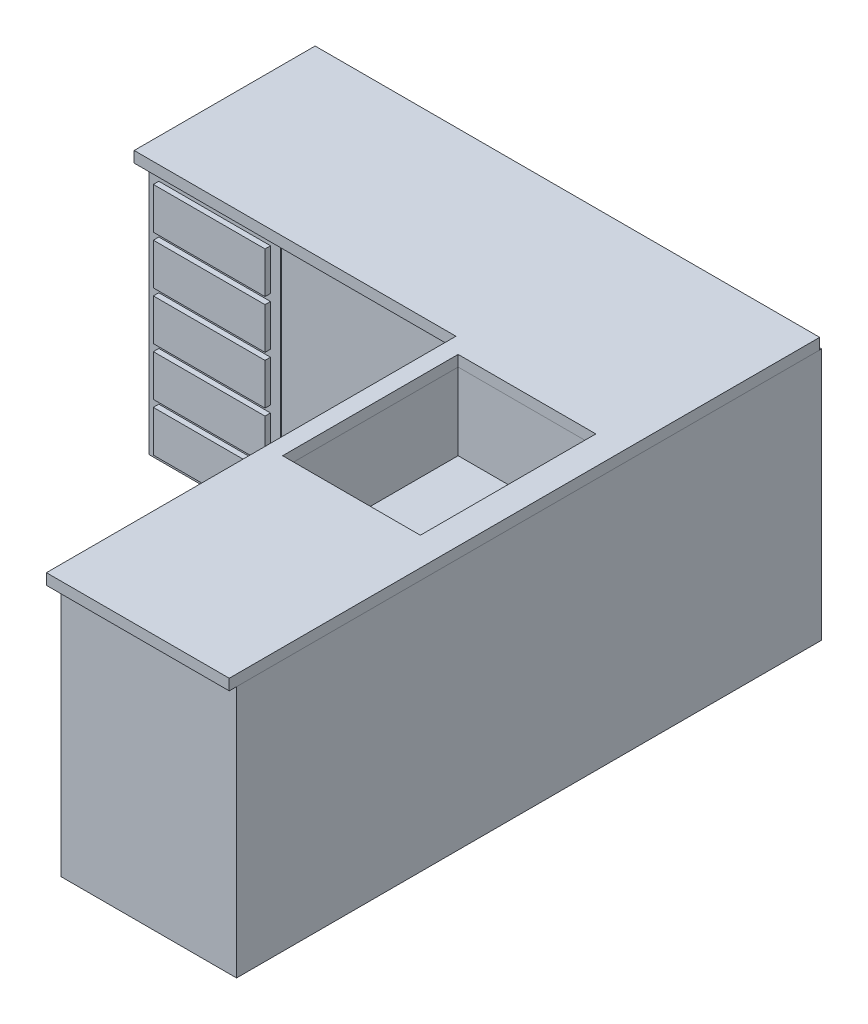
ISO-10303-21;
HEADER;
FILE_DESCRIPTION(('STEP AP214'),'2;1');
FILE_NAME('part.step','',(''),(''),'','','');
FILE_SCHEMA(('AUTOMOTIVE_DESIGN { 1 0 10303 214 1 1 1 1 }'));
ENDSEC;
DATA;
#1=APPLICATION_CONTEXT('core data for automotive mechanical design processes');
#2=APPLICATION_PROTOCOL_DEFINITION('international standard','automotive_design',2000,#1);
#3=PRODUCT_CONTEXT('',#1,'mechanical');
#4=PRODUCT('Part','Part','',(#3));
#5=PRODUCT_RELATED_PRODUCT_CATEGORY('part','',(#4));
#6=PRODUCT_DEFINITION_FORMATION('','',#4);
#7=PRODUCT_DEFINITION_CONTEXT('part definition',#1,'design');
#8=PRODUCT_DEFINITION('design','',#6,#7);
#9=PRODUCT_DEFINITION_SHAPE('','',#8);
#10=(LENGTH_UNIT() NAMED_UNIT(*) SI_UNIT(.MILLI.,.METRE.));
#11=(NAMED_UNIT(*) PLANE_ANGLE_UNIT() SI_UNIT($,.RADIAN.));
#12=(NAMED_UNIT(*) SI_UNIT($,.STERADIAN.) SOLID_ANGLE_UNIT());
#13=UNCERTAINTY_MEASURE_WITH_UNIT(LENGTH_MEASURE(1.E-05),#10,'distance_accuracy_value','');
#14=(GEOMETRIC_REPRESENTATION_CONTEXT(3) GLOBAL_UNCERTAINTY_ASSIGNED_CONTEXT((#13)) GLOBAL_UNIT_ASSIGNED_CONTEXT((#10,
#11,#12)) REPRESENTATION_CONTEXT('',''));
#15=CARTESIAN_POINT('',(0.,0.,0.));
#16=DIRECTION('',(0.,0.,1.));
#17=DIRECTION('',(1.,0.,0.));
#18=AXIS2_PLACEMENT_3D('',#15,#16,#17);
#19=CARTESIAN_POINT('',(460.375,876.3,-508.));
#20=DIRECTION('',(-1.,0.,0.));
#21=DIRECTION('',(0.,-1.,0.));
#22=AXIS2_PLACEMENT_3D('',#19,#20,#21);
#23=PLANE('',#22);
#24=DIRECTION('',(0.,-1.,0.));
#25=VECTOR('',#24,1.);
#26=CARTESIAN_POINT('',(460.375,876.3,0.));
#27=LINE('',#26,#25);
#28=CARTESIAN_POINT('',(460.375,876.3,0.));
#29=VERTEX_POINT('',#28);
#30=CARTESIAN_POINT('',(460.375,0.,0.));
#31=VERTEX_POINT('',#30);
#32=EDGE_CURVE('E114',#29,#31,#27,.T.);
#33=ORIENTED_EDGE('',*,*,#32,.F.);
#34=DIRECTION('',(0.,0.,1.));
#35=VECTOR('',#34,1.);
#36=CARTESIAN_POINT('',(460.375,876.3,-508.));
#37=LINE('',#36,#35);
#38=CARTESIAN_POINT('',(460.375,876.3,-508.));
#39=VERTEX_POINT('',#38);
#40=EDGE_CURVE('E12',#39,#29,#37,.T.);
#41=ORIENTED_EDGE('',*,*,#40,.F.);
#42=DIRECTION('',(0.,-1.,0.));
#43=VECTOR('',#42,1.);
#44=CARTESIAN_POINT('',(460.375,876.3,-508.));
#45=LINE('',#44,#43);
#46=CARTESIAN_POINT('',(460.375,0.,-508.));
#47=VERTEX_POINT('',#46);
#48=EDGE_CURVE('E108',#39,#47,#45,.T.);
#49=ORIENTED_EDGE('',*,*,#48,.T.);
#50=DIRECTION('',(0.,0.,1.));
#51=VECTOR('',#50,1.);
#52=CARTESIAN_POINT('',(460.375,0.,-508.));
#53=LINE('',#52,#51);
#54=EDGE_CURVE('E53',#47,#31,#53,.T.);
#55=ORIENTED_EDGE('',*,*,#54,.T.);
#56=EDGE_LOOP('',(#33,#41,#49,#55));
#57=FACE_BOUND('',#56,.T.);
#58=ADVANCED_FACE('F50',(#57),#23,.T.);
#59=CARTESIAN_POINT('',(460.375,876.3,-508.));
#60=DIRECTION('',(0.,1.,0.));
#61=DIRECTION('',(0.,0.,1.));
#62=AXIS2_PLACEMENT_3D('',#59,#60,#61);
#63=PLANE('',#62);
#64=DIRECTION('',(-1.,0.,0.));
#65=VECTOR('',#64,1.);
#66=CARTESIAN_POINT('',(460.375,876.3,0.));
#67=LINE('',#66,#65);
#68=CARTESIAN_POINT('',(1057.275,876.3,0.));
#69=VERTEX_POINT('',#68);
#70=EDGE_CURVE('E110',#69,#29,#67,.T.);
#71=ORIENTED_EDGE('',*,*,#70,.F.);
#72=DIRECTION('',(0.,0.,1.));
#73=VECTOR('',#72,1.);
#74=CARTESIAN_POINT('',(1057.275,876.3,-508.));
#75=LINE('',#74,#73);
#76=CARTESIAN_POINT('',(1057.275,876.3,-508.));
#77=VERTEX_POINT('',#76);
#78=EDGE_CURVE('E59',#77,#69,#75,.T.);
#79=ORIENTED_EDGE('',*,*,#78,.F.);
#80=DIRECTION('',(-1.,0.,0.));
#81=VECTOR('',#80,1.);
#82=CARTESIAN_POINT('',(460.375,876.3,-508.));
#83=LINE('',#82,#81);
#84=EDGE_CURVE('E105',#77,#39,#83,.T.);
#85=ORIENTED_EDGE('',*,*,#84,.T.);
#86=ORIENTED_EDGE('',*,*,#40,.T.);
#87=EDGE_LOOP('',(#71,#79,#85,#86));
#88=FACE_BOUND('',#87,.T.);
#89=ADVANCED_FACE('F124',(#88),#63,.T.);
#90=CARTESIAN_POINT('',(1057.275,876.3,-508.));
#91=DIRECTION('',(1.,0.,0.));
#92=DIRECTION('',(0.,0.,-1.));
#93=AXIS2_PLACEMENT_3D('',#90,#91,#92);
#94=PLANE('',#93);
#95=DIRECTION('',(0.,1.,0.));
#96=VECTOR('',#95,1.);
#97=CARTESIAN_POINT('',(1057.275,876.3,0.));
#98=LINE('',#97,#96);
#99=CARTESIAN_POINT('',(1057.275,0.,0.));
#100=VERTEX_POINT('',#99);
#101=EDGE_CURVE('E100',#100,#69,#98,.T.);
#102=ORIENTED_EDGE('',*,*,#101,.F.);
#103=DIRECTION('',(0.,0.,1.));
#104=VECTOR('',#103,1.);
#105=CARTESIAN_POINT('',(1057.275,0.,-508.));
#106=LINE('',#105,#104);
#107=CARTESIAN_POINT('',(1057.275,0.,-508.));
#108=VERTEX_POINT('',#107);
#109=EDGE_CURVE('E95',#108,#100,#106,.T.);
#110=ORIENTED_EDGE('',*,*,#109,.F.);
#111=DIRECTION('',(0.,1.,0.));
#112=VECTOR('',#111,1.);
#113=CARTESIAN_POINT('',(1057.275,876.3,-508.));
#114=LINE('',#113,#112);
#115=EDGE_CURVE('E98',#108,#77,#114,.T.);
#116=ORIENTED_EDGE('',*,*,#115,.T.);
#117=ORIENTED_EDGE('',*,*,#78,.T.);
#118=EDGE_LOOP('',(#102,#110,#116,#117));
#119=FACE_BOUND('',#118,.T.);
#120=ADVANCED_FACE('F97',(#119),#94,.T.);
#121=CARTESIAN_POINT('',(460.375,0.,-508.));
#122=DIRECTION('',(0.,-1.,0.));
#123=DIRECTION('',(0.,0.,-1.));
#124=AXIS2_PLACEMENT_3D('',#121,#122,#123);
#125=PLANE('',#124);
#126=DIRECTION('',(1.,0.,0.));
#127=VECTOR('',#126,1.);
#128=CARTESIAN_POINT('',(460.375,0.,0.));
#129=LINE('',#128,#127);
#130=EDGE_CURVE('E117',#31,#100,#129,.T.);
#131=ORIENTED_EDGE('',*,*,#130,.F.);
#132=ORIENTED_EDGE('',*,*,#54,.F.);
#133=DIRECTION('',(1.,0.,0.));
#134=VECTOR('',#133,1.);
#135=CARTESIAN_POINT('',(460.375,0.,-508.));
#136=LINE('',#135,#134);
#137=EDGE_CURVE('E104',#47,#108,#136,.T.);
#138=ORIENTED_EDGE('',*,*,#137,.T.);
#139=ORIENTED_EDGE('',*,*,#109,.T.);
#140=EDGE_LOOP('',(#131,#132,#138,#139));
#141=FACE_BOUND('',#140,.T.);
#142=ADVANCED_FACE('F107',(#141),#125,.T.);
#143=CARTESIAN_POINT('',(460.375,0.,-508.));
#144=DIRECTION('',(0.,0.,1.));
#145=DIRECTION('',(1.,0.,0.));
#146=AXIS2_PLACEMENT_3D('',#143,#144,#145);
#147=PLANE('',#146);
#148=ORIENTED_EDGE('',*,*,#48,.F.);
#149=ORIENTED_EDGE('',*,*,#84,.F.);
#150=ORIENTED_EDGE('',*,*,#115,.F.);
#151=ORIENTED_EDGE('',*,*,#137,.F.);
#152=EDGE_LOOP('',(#148,#149,#150,#151));
#153=FACE_BOUND('',#152,.T.);
#154=ADVANCED_FACE('F103',(#153),#147,.F.);
#155=CARTESIAN_POINT('',(460.375,0.,0.));
#156=DIRECTION('',(0.,0.,1.));
#157=DIRECTION('',(1.,0.,0.));
#158=AXIS2_PLACEMENT_3D('',#155,#156,#157);
#159=PLANE('',#158);
#160=ORIENTED_EDGE('',*,*,#32,.T.);
#161=ORIENTED_EDGE('',*,*,#130,.T.);
#162=ORIENTED_EDGE('',*,*,#101,.T.);
#163=ORIENTED_EDGE('',*,*,#70,.T.);
#164=EDGE_LOOP('',(#160,#161,#162,#163));
#165=FACE_BOUND('',#164,.T.);
#166=ADVANCED_FACE('F123',(#165),#159,.T.);
#167=CLOSED_SHELL('',(#58,#89,#120,#142,#154,#166));
#168=MANIFOLD_SOLID_BREP('B2',#167);
#169=CARTESIAN_POINT('',(1117.6,876.3,1422.4));
#170=DIRECTION('',(1.,0.,0.));
#171=DIRECTION('',(0.,0.,-1.));
#172=AXIS2_PLACEMENT_3D('',#169,#170,#171);
#173=PLANE('',#172);
#174=DIRECTION('',(0.,-1.,0.));
#175=VECTOR('',#174,1.);
#176=CARTESIAN_POINT('',(1117.6,671.312390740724,18.8378352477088));
#177=LINE('',#176,#175);
#178=CARTESIAN_POINT('',(1117.6,671.312390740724,18.8378352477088));
#179=VERTEX_POINT('',#178);
#180=CARTESIAN_POINT('',(1117.6,22.6268224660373,18.8378352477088));
#181=VERTEX_POINT('',#180);
#182=EDGE_CURVE('E437',#179,#181,#177,.T.);
#183=ORIENTED_EDGE('',*,*,#182,.F.);
#184=DIRECTION('',(0.,0.,-1.));
#185=VECTOR('',#184,1.);
#186=CARTESIAN_POINT('',(1117.6,671.312390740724,18.8378352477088));
#187=LINE('',#186,#185);
#188=CARTESIAN_POINT('',(1117.6,671.312390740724,372.230406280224));
#189=VERTEX_POINT('',#188);
#190=EDGE_CURVE('E450',#189,#179,#187,.T.);
#191=ORIENTED_EDGE('',*,*,#190,.F.);
#192=DIRECTION('',(0.,1.,0.));
#193=VECTOR('',#192,1.);
#194=CARTESIAN_POINT('',(1117.6,671.312390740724,372.230406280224));
#195=LINE('',#194,#193);
#196=CARTESIAN_POINT('',(1117.6,22.6268224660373,372.230406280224));
#197=VERTEX_POINT('',#196);
#198=EDGE_CURVE('E459',#197,#189,#195,.T.);
#199=ORIENTED_EDGE('',*,*,#198,.F.);
#200=DIRECTION('',(0.,0.,1.));
#201=VECTOR('',#200,1.);
#202=CARTESIAN_POINT('',(1117.6,22.6268224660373,18.8378352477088));
#203=LINE('',#202,#201);
#204=EDGE_CURVE('E440',#181,#197,#203,.T.);
#205=ORIENTED_EDGE('',*,*,#204,.F.);
#206=EDGE_LOOP('',(#183,#191,#199,#205));
#207=FACE_BOUND('',#206,.T.);
#208=DIRECTION('',(0.,0.,-1.));
#209=VECTOR('',#208,1.);
#210=CARTESIAN_POINT('',(1117.6,0.,1422.4));
#211=LINE('',#210,#209);
#212=CARTESIAN_POINT('',(1117.6,0.,762.));
#213=VERTEX_POINT('',#212);
#214=CARTESIAN_POINT('',(1117.6,0.,0.));
#215=VERTEX_POINT('',#214);
#216=EDGE_CURVE('E643',#213,#215,#211,.T.);
#217=ORIENTED_EDGE('',*,*,#216,.F.);
#218=DIRECTION('',(0.,1.,0.));
#219=VECTOR('',#218,1.);
#220=CARTESIAN_POINT('',(1117.6,876.3,762.));
#221=LINE('',#220,#219);
#222=CARTESIAN_POINT('',(1117.6,741.090401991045,762.));
#223=VERTEX_POINT('',#222);
#224=EDGE_CURVE('E720',#213,#223,#221,.T.);
#225=ORIENTED_EDGE('',*,*,#224,.T.);
#226=DIRECTION('',(0.,1.,0.));
#227=VECTOR('',#226,1.);
#228=CARTESIAN_POINT('',(1117.6,876.3,762.));
#229=LINE('',#228,#227);
#230=CARTESIAN_POINT('',(1117.6,876.3,762.));
#231=VERTEX_POINT('',#230);
#232=EDGE_CURVE('E687',#223,#231,#229,.T.);
#233=ORIENTED_EDGE('',*,*,#232,.T.);
#234=DIRECTION('',(0.,0.,-1.));
#235=VECTOR('',#234,1.);
#236=CARTESIAN_POINT('',(1117.6,876.3,1422.4));
#237=LINE('',#236,#235);
#238=CARTESIAN_POINT('',(1117.6,876.3,0.));
#239=VERTEX_POINT('',#238);
#240=EDGE_CURVE('E648',#231,#239,#237,.T.);
#241=ORIENTED_EDGE('',*,*,#240,.T.);
#242=DIRECTION('',(0.,-1.,0.));
#243=VECTOR('',#242,1.);
#244=CARTESIAN_POINT('',(1117.6,876.3,0.));
#245=LINE('',#244,#243);
#246=EDGE_CURVE('E653',#239,#215,#245,.T.);
#247=ORIENTED_EDGE('',*,*,#246,.T.);
#248=EDGE_LOOP('',(#217,#225,#233,#241,#247));
#249=FACE_BOUND('',#248,.T.);
#250=DIRECTION('',(0.,-1.,0.));
#251=VECTOR('',#250,1.);
#252=CARTESIAN_POINT('',(1117.6,847.286170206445,18.8378352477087));
#253=LINE('',#252,#251);
#254=CARTESIAN_POINT('',(1117.6,847.286170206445,18.8378352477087));
#255=VERTEX_POINT('',#254);
#256=CARTESIAN_POINT('',(1117.6,692.378253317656,18.8378352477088));
#257=VERTEX_POINT('',#256);
#258=EDGE_CURVE('E475',#255,#257,#253,.T.);
#259=ORIENTED_EDGE('',*,*,#258,.F.);
#260=DIRECTION('',(0.,0.,-1.));
#261=VECTOR('',#260,1.);
#262=CARTESIAN_POINT('',(1117.6,847.286170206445,18.8378352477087));
#263=LINE('',#262,#261);
#264=CARTESIAN_POINT('',(1117.6,847.286170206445,743.162164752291));
#265=VERTEX_POINT('',#264);
#266=EDGE_CURVE('E480',#265,#255,#263,.T.);
#267=ORIENTED_EDGE('',*,*,#266,.F.);
#268=DIRECTION('',(0.,1.,0.));
#269=VECTOR('',#268,1.);
#270=CARTESIAN_POINT('',(1117.6,847.286170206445,743.162164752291));
#271=LINE('',#270,#269);
#272=CARTESIAN_POINT('',(1117.6,692.378253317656,743.162164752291));
#273=VERTEX_POINT('',#272);
#274=EDGE_CURVE('E492',#273,#265,#271,.T.);
#275=ORIENTED_EDGE('',*,*,#274,.F.);
#276=DIRECTION('',(0.,0.,1.));
#277=VECTOR('',#276,1.);
#278=CARTESIAN_POINT('',(1117.6,692.378253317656,18.8378352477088));
#279=LINE('',#278,#277);
#280=EDGE_CURVE('E489',#257,#273,#279,.T.);
#281=ORIENTED_EDGE('',*,*,#280,.F.);
#282=EDGE_LOOP('',(#259,#267,#275,#281));
#283=FACE_BOUND('',#282,.T.);
#284=DIRECTION('',(0.,-1.,0.));
#285=VECTOR('',#284,1.);
#286=CARTESIAN_POINT('',(1117.6,671.312390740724,389.769593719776));
#287=LINE('',#286,#285);
#288=CARTESIAN_POINT('',(1117.6,671.312390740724,389.769593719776));
#289=VERTEX_POINT('',#288);
#290=CARTESIAN_POINT('',(1117.6,22.6268224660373,389.769593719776));
#291=VERTEX_POINT('',#290);
#292=EDGE_CURVE('E436',#289,#291,#287,.T.);
#293=ORIENTED_EDGE('',*,*,#292,.F.);
#294=DIRECTION('',(0.,0.,-1.));
#295=VECTOR('',#294,1.);
#296=CARTESIAN_POINT('',(1117.6,671.312390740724,389.769593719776));
#297=LINE('',#296,#295);
#298=CARTESIAN_POINT('',(1117.6,671.312390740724,743.162164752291));
#299=VERTEX_POINT('',#298);
#300=EDGE_CURVE('E433',#299,#289,#297,.T.);
#301=ORIENTED_EDGE('',*,*,#300,.F.);
#302=DIRECTION('',(0.,1.,0.));
#303=VECTOR('',#302,1.);
#304=CARTESIAN_POINT('',(1117.6,671.312390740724,743.162164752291));
#305=LINE('',#304,#303);
#306=CARTESIAN_POINT('',(1117.6,22.6268224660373,743.162164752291));
#307=VERTEX_POINT('',#306);
#308=EDGE_CURVE('E206',#307,#299,#305,.T.);
#309=ORIENTED_EDGE('',*,*,#308,.F.);
#310=DIRECTION('',(0.,0.,1.));
#311=VECTOR('',#310,1.);
#312=CARTESIAN_POINT('',(1117.6,22.6268224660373,389.769593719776));
#313=LINE('',#312,#311);
#314=EDGE_CURVE('E201',#291,#307,#313,.T.);
#315=ORIENTED_EDGE('',*,*,#314,.F.);
#316=EDGE_LOOP('',(#293,#301,#309,#315));
#317=FACE_BOUND('',#316,.T.);
#318=ADVANCED_FACE('F186',(#207,#249,#283,#317),#173,.F.);
#319=DIRECTION('',(0.,-1.,0.));
#320=VECTOR('',#319,1.);
#321=CARTESIAN_POINT('',(1117.6,567.084776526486,781.140592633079));
#322=LINE('',#321,#320);
#323=CARTESIAN_POINT('',(1117.6,567.084776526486,781.140592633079));
#324=VERTEX_POINT('',#323);
#325=CARTESIAN_POINT('',(1117.6,312.717180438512,781.140592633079));
#326=VERTEX_POINT('',#325);
#327=EDGE_CURVE('E541',#324,#326,#322,.T.);
#328=ORIENTED_EDGE('',*,*,#327,.F.);
#329=DIRECTION('',(0.,0.,-1.));
#330=VECTOR('',#329,1.);
#331=CARTESIAN_POINT('',(1117.6,567.084776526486,781.140592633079));
#332=LINE('',#331,#330);
#333=CARTESIAN_POINT('',(1117.6,567.084776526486,1388.47615561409));
#334=VERTEX_POINT('',#333);
#335=EDGE_CURVE('E546',#334,#324,#332,.T.);
#336=ORIENTED_EDGE('',*,*,#335,.F.);
#337=DIRECTION('',(0.,1.,0.));
#338=VECTOR('',#337,1.);
#339=CARTESIAN_POINT('',(1117.6,567.084776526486,1388.47615561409));
#340=LINE('',#339,#338);
#341=CARTESIAN_POINT('',(1117.6,312.717180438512,1388.47615561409));
#342=VERTEX_POINT('',#341);
#343=EDGE_CURVE('E558',#342,#334,#340,.T.);
#344=ORIENTED_EDGE('',*,*,#343,.F.);
#345=DIRECTION('',(0.,0.,1.));
#346=VECTOR('',#345,1.);
#347=CARTESIAN_POINT('',(1117.6,312.717180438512,781.140592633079));
#348=LINE('',#347,#346);
#349=EDGE_CURVE('E555',#326,#342,#348,.T.);
#350=ORIENTED_EDGE('',*,*,#349,.F.);
#351=EDGE_LOOP('',(#328,#336,#344,#350));
#352=FACE_BOUND('',#351,.T.);
#353=ORIENTED_EDGE('',*,*,#224,.F.);
#354=CARTESIAN_POINT('',(1117.6,0.,1422.4));
#355=VERTEX_POINT('',#354);
#356=EDGE_CURVE('E646',#355,#213,#211,.T.);
#357=ORIENTED_EDGE('',*,*,#356,.F.);
#358=DIRECTION('',(0.,-1.,0.));
#359=VECTOR('',#358,1.);
#360=CARTESIAN_POINT('',(1117.6,876.3,1422.4));
#361=LINE('',#360,#359);
#362=CARTESIAN_POINT('',(1117.6,876.3,1422.4));
#363=VERTEX_POINT('',#362);
#364=EDGE_CURVE('E678',#363,#355,#361,.T.);
#365=ORIENTED_EDGE('',*,*,#364,.F.);
#366=EDGE_CURVE('E681',#363,#231,#237,.T.);
#367=ORIENTED_EDGE('',*,*,#366,.T.);
#368=ORIENTED_EDGE('',*,*,#232,.F.);
#369=EDGE_LOOP('',(#353,#357,#365,#367,#368));
#370=FACE_BOUND('',#369,.T.);
#371=DIRECTION('',(0.,-1.,0.));
#372=VECTOR('',#371,1.);
#373=CARTESIAN_POINT('',(1117.6,833.784776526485,781.140592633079));
#374=LINE('',#373,#372);
#375=CARTESIAN_POINT('',(1117.6,833.784776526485,781.140592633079));
#376=VERTEX_POINT('',#375);
#377=CARTESIAN_POINT('',(1117.6,579.417180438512,781.140592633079));
#378=VERTEX_POINT('',#377);
#379=EDGE_CURVE('E574',#376,#378,#374,.T.);
#380=ORIENTED_EDGE('',*,*,#379,.F.);
#381=DIRECTION('',(0.,0.,-1.));
#382=VECTOR('',#381,1.);
#383=CARTESIAN_POINT('',(1117.6,833.784776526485,781.140592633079));
#384=LINE('',#383,#382);
#385=CARTESIAN_POINT('',(1117.6,833.784776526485,1388.47615561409));
#386=VERTEX_POINT('',#385);
#387=EDGE_CURVE('E579',#386,#376,#384,.T.);
#388=ORIENTED_EDGE('',*,*,#387,.F.);
#389=DIRECTION('',(0.,1.,0.));
#390=VECTOR('',#389,1.);
#391=CARTESIAN_POINT('',(1117.6,833.784776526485,1388.47615561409));
#392=LINE('',#391,#390);
#393=CARTESIAN_POINT('',(1117.6,579.417180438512,1388.47615561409));
#394=VERTEX_POINT('',#393);
#395=EDGE_CURVE('E591',#394,#386,#392,.T.);
#396=ORIENTED_EDGE('',*,*,#395,.F.);
#397=DIRECTION('',(0.,0.,1.));
#398=VECTOR('',#397,1.);
#399=CARTESIAN_POINT('',(1117.6,579.417180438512,781.140592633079));
#400=LINE('',#399,#398);
#401=EDGE_CURVE('E588',#378,#394,#400,.T.);
#402=ORIENTED_EDGE('',*,*,#401,.F.);
#403=EDGE_LOOP('',(#380,#388,#396,#402));
#404=FACE_BOUND('',#403,.T.);
#405=DIRECTION('',(0.,-1.,0.));
#406=VECTOR('',#405,1.);
#407=CARTESIAN_POINT('',(1117.6,300.384776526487,781.140592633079));
#408=LINE('',#407,#406);
#409=CARTESIAN_POINT('',(1117.6,300.384776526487,781.140592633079));
#410=VERTEX_POINT('',#409);
#411=CARTESIAN_POINT('',(1117.6,46.017180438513,781.140592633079));
#412=VERTEX_POINT('',#411);
#413=EDGE_CURVE('E508',#410,#412,#408,.T.);
#414=ORIENTED_EDGE('',*,*,#413,.F.);
#415=DIRECTION('',(0.,0.,-1.));
#416=VECTOR('',#415,1.);
#417=CARTESIAN_POINT('',(1117.6,300.384776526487,781.140592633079));
#418=LINE('',#417,#416);
#419=CARTESIAN_POINT('',(1117.6,300.384776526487,1388.47615561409));
#420=VERTEX_POINT('',#419);
#421=EDGE_CURVE('E513',#420,#410,#418,.T.);
#422=ORIENTED_EDGE('',*,*,#421,.F.);
#423=DIRECTION('',(0.,1.,0.));
#424=VECTOR('',#423,1.);
#425=CARTESIAN_POINT('',(1117.6,300.384776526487,1388.47615561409));
#426=LINE('',#425,#424);
#427=CARTESIAN_POINT('',(1117.6,46.017180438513,1388.47615561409));
#428=VERTEX_POINT('',#427);
#429=EDGE_CURVE('E525',#428,#420,#426,.T.);
#430=ORIENTED_EDGE('',*,*,#429,.F.);
#431=DIRECTION('',(0.,0.,1.));
#432=VECTOR('',#431,1.);
#433=CARTESIAN_POINT('',(1117.6,46.017180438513,781.140592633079));
#434=LINE('',#433,#432);
#435=EDGE_CURVE('E522',#412,#428,#434,.T.);
#436=ORIENTED_EDGE('',*,*,#435,.F.);
#437=EDGE_LOOP('',(#414,#422,#430,#436));
#438=FACE_BOUND('',#437,.T.);
#439=ADVANCED_FACE('F716',(#352,#370,#404,#438),#173,.F.);
#440=CARTESIAN_POINT('',(0.,876.3,0.));
#441=DIRECTION('',(0.,0.,-1.));
#442=DIRECTION('',(-1.,0.,0.));
#443=AXIS2_PLACEMENT_3D('',#440,#441,#442);
#444=PLANE('',#443);
#445=DIRECTION('',(-1.,0.,0.));
#446=VECTOR('',#445,1.);
#447=CARTESIAN_POINT('',(0.,876.3,0.));
#448=LINE('',#447,#446);
#449=CARTESIAN_POINT('',(1066.8,876.3,0.));
#450=VERTEX_POINT('',#449);
#451=EDGE_CURVE('E623',#239,#450,#448,.T.);
#452=ORIENTED_EDGE('',*,*,#451,.T.);
#453=DIRECTION('',(0.,1.,0.));
#454=VECTOR('',#453,1.);
#455=CARTESIAN_POINT('',(1066.8,876.3,0.));
#456=LINE('',#455,#454);
#457=CARTESIAN_POINT('',(1066.8,0.,0.));
#458=VERTEX_POINT('',#457);
#459=EDGE_CURVE('E671',#458,#450,#456,.T.);
#460=ORIENTED_EDGE('',*,*,#459,.F.);
#461=DIRECTION('',(1.,0.,0.));
#462=VECTOR('',#461,1.);
#463=CARTESIAN_POINT('',(0.,0.,0.));
#464=LINE('',#463,#462);
#465=EDGE_CURVE('E631',#458,#215,#464,.T.);
#466=ORIENTED_EDGE('',*,*,#465,.T.);
#467=ORIENTED_EDGE('',*,*,#246,.F.);
#468=EDGE_LOOP('',(#452,#460,#466,#467));
#469=FACE_BOUND('',#468,.T.);
#470=ADVANCED_FACE('F188',(#469),#444,.F.);
#471=CARTESIAN_POINT('',(0.,876.3,-609.6));
#472=DIRECTION('',(0.,1.,0.));
#473=DIRECTION('',(0.,0.,1.));
#474=AXIS2_PLACEMENT_3D('',#471,#472,#473);
#475=PLANE('',#474);
#476=DIRECTION('',(0.,0.,1.));
#477=VECTOR('',#476,1.);
#478=CARTESIAN_POINT('',(1150.5809653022,876.3,-609.6));
#479=LINE('',#478,#477);
#480=CARTESIAN_POINT('',(1150.5809653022,876.3,76.1999999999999));
#481=VERTEX_POINT('',#480);
#482=CARTESIAN_POINT('',(1150.5809653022,876.3,685.8));
#483=VERTEX_POINT('',#482);
#484=EDGE_CURVE('E48',#481,#483,#479,.T.);
#485=ORIENTED_EDGE('',*,*,#484,.F.);
#486=DIRECTION('',(-1.,0.,0.));
#487=VECTOR('',#486,1.);
#488=CARTESIAN_POINT('',(3.18329056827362E-13,876.3,76.2000000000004));
#489=LINE('',#488,#487);
#490=CARTESIAN_POINT('',(1628.94819817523,876.3,76.1999999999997));
#491=VERTEX_POINT('',#490);
#492=EDGE_CURVE('E194',#491,#481,#489,.T.);
#493=ORIENTED_EDGE('',*,*,#492,.F.);
#494=DIRECTION('',(0.,0.,-1.));
#495=VECTOR('',#494,1.);
#496=CARTESIAN_POINT('',(1628.94819817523,876.3,-609.600000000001));
#497=LINE('',#496,#495);
#498=CARTESIAN_POINT('',(1628.94819817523,876.3,685.8));
#499=VERTEX_POINT('',#498);
#500=EDGE_CURVE('E1183',#499,#491,#497,.T.);
#501=ORIENTED_EDGE('',*,*,#500,.F.);
#502=DIRECTION('',(1.,0.,0.));
#503=VECTOR('',#502,1.);
#504=CARTESIAN_POINT('',(0.,876.3,685.8));
#505=LINE('',#504,#503);
#506=EDGE_CURVE('E723',#483,#499,#505,.T.);
#507=ORIENTED_EDGE('',*,*,#506,.F.);
#508=EDGE_LOOP('',(#485,#493,#501,#507));
#509=FACE_BOUND('',#508,.T.);
#510=DIRECTION('',(0.,0.,1.));
#511=VECTOR('',#510,1.);
#512=CARTESIAN_POINT('',(1066.8,876.3,-609.6));
#513=LINE('',#512,#511);
#514=CARTESIAN_POINT('',(1066.8,876.3,-609.6));
#515=VERTEX_POINT('',#514);
#516=EDGE_CURVE('E635',#515,#450,#513,.T.);
#517=ORIENTED_EDGE('',*,*,#516,.T.);
#518=ORIENTED_EDGE('',*,*,#451,.F.);
#519=ORIENTED_EDGE('',*,*,#240,.F.);
#520=ORIENTED_EDGE('',*,*,#366,.F.);
#521=DIRECTION('',(-1.,0.,0.));
#522=VECTOR('',#521,1.);
#523=CARTESIAN_POINT('',(1117.6,876.3,1422.4));
#524=LINE('',#523,#522);
#525=CARTESIAN_POINT('',(1727.2,876.3,1422.4));
#526=VERTEX_POINT('',#525);
#527=EDGE_CURVE('E669',#526,#363,#524,.T.);
#528=ORIENTED_EDGE('',*,*,#527,.F.);
#529=DIRECTION('',(0.,0.,1.));
#530=VECTOR('',#529,1.);
#531=CARTESIAN_POINT('',(1727.2,876.3,-609.6));
#532=LINE('',#531,#530);
#533=CARTESIAN_POINT('',(1727.2,876.3,-609.6));
#534=VERTEX_POINT('',#533);
#535=EDGE_CURVE('E663',#534,#526,#532,.T.);
#536=ORIENTED_EDGE('',*,*,#535,.F.);
#537=DIRECTION('',(-1.,0.,0.));
#538=VECTOR('',#537,1.);
#539=CARTESIAN_POINT('',(0.,876.3,-609.6));
#540=LINE('',#539,#538);
#541=EDGE_CURVE('E684',#534,#515,#540,.T.);
#542=ORIENTED_EDGE('',*,*,#541,.T.);
#543=EDGE_LOOP('',(#517,#518,#519,#520,#528,#536,#542));
#544=FACE_BOUND('',#543,.T.);
#545=ADVANCED_FACE('F706',(#509,#544),#475,.T.);
#546=CARTESIAN_POINT('',(0.,0.,-609.6));
#547=DIRECTION('',(0.,-1.,0.));
#548=DIRECTION('',(0.,0.,-1.));
#549=AXIS2_PLACEMENT_3D('',#546,#547,#548);
#550=PLANE('',#549);
#551=DIRECTION('',(0.,0.,1.));
#552=VECTOR('',#551,1.);
#553=CARTESIAN_POINT('',(1066.8,0.,-609.6));
#554=LINE('',#553,#552);
#555=CARTESIAN_POINT('',(1066.8,0.,-609.6));
#556=VERTEX_POINT('',#555);
#557=EDGE_CURVE('E685',#556,#458,#554,.T.);
#558=ORIENTED_EDGE('',*,*,#557,.F.);
#559=DIRECTION('',(1.,0.,0.));
#560=VECTOR('',#559,1.);
#561=CARTESIAN_POINT('',(0.,0.,-609.6));
#562=LINE('',#561,#560);
#563=CARTESIAN_POINT('',(1727.2,0.,-609.6));
#564=VERTEX_POINT('',#563);
#565=EDGE_CURVE('E662',#556,#564,#562,.T.);
#566=ORIENTED_EDGE('',*,*,#565,.T.);
#567=DIRECTION('',(0.,0.,1.));
#568=VECTOR('',#567,1.);
#569=CARTESIAN_POINT('',(1727.2,0.,-609.6));
#570=LINE('',#569,#568);
#571=CARTESIAN_POINT('',(1727.2,0.,1422.4));
#572=VERTEX_POINT('',#571);
#573=EDGE_CURVE('E647',#564,#572,#570,.T.);
#574=ORIENTED_EDGE('',*,*,#573,.T.);
#575=DIRECTION('',(1.,0.,0.));
#576=VECTOR('',#575,1.);
#577=CARTESIAN_POINT('',(1117.6,0.,1422.4));
#578=LINE('',#577,#576);
#579=EDGE_CURVE('E675',#355,#572,#578,.T.);
#580=ORIENTED_EDGE('',*,*,#579,.F.);
#581=ORIENTED_EDGE('',*,*,#356,.T.);
#582=ORIENTED_EDGE('',*,*,#216,.T.);
#583=ORIENTED_EDGE('',*,*,#465,.F.);
#584=EDGE_LOOP('',(#558,#566,#574,#580,#581,#582,#583));
#585=FACE_BOUND('',#584,.T.);
#586=ADVANCED_FACE('F696',(#585),#550,.T.);
#587=CARTESIAN_POINT('',(0.,876.3,-609.6));
#588=DIRECTION('',(0.,0.,-1.));
#589=DIRECTION('',(-1.,0.,0.));
#590=AXIS2_PLACEMENT_3D('',#587,#588,#589);
#591=PLANE('',#590);
#592=DIRECTION('',(0.,1.,0.));
#593=VECTOR('',#592,1.);
#594=CARTESIAN_POINT('',(1066.8,876.3,-609.6));
#595=LINE('',#594,#593);
#596=EDGE_CURVE('E658',#556,#515,#595,.T.);
#597=ORIENTED_EDGE('',*,*,#596,.T.);
#598=ORIENTED_EDGE('',*,*,#541,.F.);
#599=DIRECTION('',(0.,1.,0.));
#600=VECTOR('',#599,1.);
#601=CARTESIAN_POINT('',(1727.2,0.,-609.6));
#602=LINE('',#601,#600);
#603=EDGE_CURVE('E665',#564,#534,#602,.T.);
#604=ORIENTED_EDGE('',*,*,#603,.F.);
#605=ORIENTED_EDGE('',*,*,#565,.F.);
#606=EDGE_LOOP('',(#597,#598,#604,#605));
#607=FACE_BOUND('',#606,.T.);
#608=ADVANCED_FACE('F704',(#607),#591,.T.);
#609=CARTESIAN_POINT('',(1727.2,0.,-609.6));
#610=DIRECTION('',(1.,0.,0.));
#611=DIRECTION('',(0.,0.,-1.));
#612=AXIS2_PLACEMENT_3D('',#609,#610,#611);
#613=PLANE('',#612);
#614=ORIENTED_EDGE('',*,*,#535,.T.);
#615=DIRECTION('',(0.,1.,0.));
#616=VECTOR('',#615,1.);
#617=CARTESIAN_POINT('',(1727.2,876.3,1422.4));
#618=LINE('',#617,#616);
#619=EDGE_CURVE('E672',#572,#526,#618,.T.);
#620=ORIENTED_EDGE('',*,*,#619,.F.);
#621=ORIENTED_EDGE('',*,*,#573,.F.);
#622=ORIENTED_EDGE('',*,*,#603,.T.);
#623=EDGE_LOOP('',(#614,#620,#621,#622));
#624=FACE_BOUND('',#623,.T.);
#625=ADVANCED_FACE('F702',(#624),#613,.T.);
#626=CARTESIAN_POINT('',(1117.6,0.,1422.4));
#627=DIRECTION('',(0.,0.,1.));
#628=DIRECTION('',(1.,0.,0.));
#629=AXIS2_PLACEMENT_3D('',#626,#627,#628);
#630=PLANE('',#629);
#631=ORIENTED_EDGE('',*,*,#364,.T.);
#632=ORIENTED_EDGE('',*,*,#579,.T.);
#633=ORIENTED_EDGE('',*,*,#619,.T.);
#634=ORIENTED_EDGE('',*,*,#527,.T.);
#635=EDGE_LOOP('',(#631,#632,#633,#634));
#636=FACE_BOUND('',#635,.T.);
#637=ADVANCED_FACE('F711',(#636),#630,.T.);
#638=CARTESIAN_POINT('',(1066.8,876.3,-609.6));
#639=DIRECTION('',(1.,0.,0.));
#640=DIRECTION('',(0.,0.,-1.));
#641=AXIS2_PLACEMENT_3D('',#638,#639,#640);
#642=PLANE('',#641);
#643=ORIENTED_EDGE('',*,*,#459,.T.);
#644=ORIENTED_EDGE('',*,*,#516,.F.);
#645=ORIENTED_EDGE('',*,*,#596,.F.);
#646=ORIENTED_EDGE('',*,*,#557,.T.);
#647=EDGE_LOOP('',(#643,#644,#645,#646));
#648=FACE_BOUND('',#647,.T.);
#649=ADVANCED_FACE('F731',(#648),#642,.F.);
#650=CARTESIAN_POINT('',(1150.5809653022,609.6,76.1999999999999));
#651=DIRECTION('',(-1.,0.,0.));
#652=DIRECTION('',(0.,0.,1.));
#653=AXIS2_PLACEMENT_3D('',#650,#651,#652);
#654=PLANE('',#653);
#655=ORIENTED_EDGE('',*,*,#484,.T.);
#656=DIRECTION('',(0.,1.,0.));
#657=VECTOR('',#656,1.);
#658=CARTESIAN_POINT('',(1150.5809653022,609.6,685.8));
#659=LINE('',#658,#657);
#660=CARTESIAN_POINT('',(1150.5809653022,609.6,685.8));
#661=VERTEX_POINT('',#660);
#662=EDGE_CURVE('E619',#661,#483,#659,.T.);
#663=ORIENTED_EDGE('',*,*,#662,.F.);
#664=DIRECTION('',(0.,0.,1.));
#665=VECTOR('',#664,1.);
#666=CARTESIAN_POINT('',(1150.5809653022,609.6,76.1999999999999));
#667=LINE('',#666,#665);
#668=CARTESIAN_POINT('',(1150.5809653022,609.6,76.1999999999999));
#669=VERTEX_POINT('',#668);
#670=EDGE_CURVE('E607',#669,#661,#667,.T.);
#671=ORIENTED_EDGE('',*,*,#670,.F.);
#672=DIRECTION('',(0.,1.,0.));
#673=VECTOR('',#672,1.);
#674=CARTESIAN_POINT('',(1150.5809653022,609.6,76.1999999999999));
#675=LINE('',#674,#673);
#676=EDGE_CURVE('E620',#669,#481,#675,.T.);
#677=ORIENTED_EDGE('',*,*,#676,.T.);
#678=EDGE_LOOP('',(#655,#663,#671,#677));
#679=FACE_BOUND('',#678,.T.);
#680=ADVANCED_FACE('F733',(#679),#654,.F.);
#681=CARTESIAN_POINT('',(1150.5809653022,609.6,76.1999999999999));
#682=DIRECTION('',(0.,0.,-1.));
#683=DIRECTION('',(-1.,0.,0.));
#684=AXIS2_PLACEMENT_3D('',#681,#682,#683);
#685=PLANE('',#684);
#686=ORIENTED_EDGE('',*,*,#492,.T.);
#687=ORIENTED_EDGE('',*,*,#676,.F.);
#688=DIRECTION('',(-1.,0.,0.));
#689=VECTOR('',#688,1.);
#690=CARTESIAN_POINT('',(1150.5809653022,609.6,76.1999999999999));
#691=LINE('',#690,#689);
#692=CARTESIAN_POINT('',(1628.94819817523,609.6,76.1999999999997));
#693=VERTEX_POINT('',#692);
#694=EDGE_CURVE('E616',#693,#669,#691,.T.);
#695=ORIENTED_EDGE('',*,*,#694,.F.);
#696=DIRECTION('',(0.,1.,0.));
#697=VECTOR('',#696,1.);
#698=CARTESIAN_POINT('',(1628.94819817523,609.6,76.1999999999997));
#699=LINE('',#698,#697);
#700=EDGE_CURVE('E624',#693,#491,#699,.T.);
#701=ORIENTED_EDGE('',*,*,#700,.T.);
#702=EDGE_LOOP('',(#686,#687,#695,#701));
#703=FACE_BOUND('',#702,.T.);
#704=ADVANCED_FACE('F739',(#703),#685,.F.);
#705=CARTESIAN_POINT('',(1628.94819817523,609.6,76.1999999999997));
#706=DIRECTION('',(1.,0.,0.));
#707=DIRECTION('',(0.,0.,-1.));
#708=AXIS2_PLACEMENT_3D('',#705,#706,#707);
#709=PLANE('',#708);
#710=ORIENTED_EDGE('',*,*,#500,.T.);
#711=ORIENTED_EDGE('',*,*,#700,.F.);
#712=DIRECTION('',(0.,0.,-1.));
#713=VECTOR('',#712,1.);
#714=CARTESIAN_POINT('',(1628.94819817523,609.6,76.1999999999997));
#715=LINE('',#714,#713);
#716=CARTESIAN_POINT('',(1628.94819817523,609.6,685.8));
#717=VERTEX_POINT('',#716);
#718=EDGE_CURVE('E613',#717,#693,#715,.T.);
#719=ORIENTED_EDGE('',*,*,#718,.F.);
#720=DIRECTION('',(0.,1.,0.));
#721=VECTOR('',#720,1.);
#722=CARTESIAN_POINT('',(1628.94819817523,609.6,685.8));
#723=LINE('',#722,#721);
#724=EDGE_CURVE('E627',#717,#499,#723,.T.);
#725=ORIENTED_EDGE('',*,*,#724,.T.);
#726=EDGE_LOOP('',(#710,#711,#719,#725));
#727=FACE_BOUND('',#726,.T.);
#728=ADVANCED_FACE('F758',(#727),#709,.F.);
#729=CARTESIAN_POINT('',(1150.5809653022,609.6,685.8));
#730=DIRECTION('',(0.,0.,1.));
#731=DIRECTION('',(1.,0.,0.));
#732=AXIS2_PLACEMENT_3D('',#729,#730,#731);
#733=PLANE('',#732);
#734=ORIENTED_EDGE('',*,*,#506,.T.);
#735=ORIENTED_EDGE('',*,*,#724,.F.);
#736=DIRECTION('',(1.,0.,0.));
#737=VECTOR('',#736,1.);
#738=CARTESIAN_POINT('',(1150.5809653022,609.6,685.8));
#739=LINE('',#738,#737);
#740=EDGE_CURVE('E610',#661,#717,#739,.T.);
#741=ORIENTED_EDGE('',*,*,#740,.F.);
#742=ORIENTED_EDGE('',*,*,#662,.T.);
#743=EDGE_LOOP('',(#734,#735,#741,#742));
#744=FACE_BOUND('',#743,.T.);
#745=ADVANCED_FACE('F754',(#744),#733,.F.);
#746=CARTESIAN_POINT('',(1150.5809653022,609.6,685.8));
#747=DIRECTION('',(0.,1.,0.));
#748=DIRECTION('',(0.,0.,1.));
#749=AXIS2_PLACEMENT_3D('',#746,#747,#748);
#750=PLANE('',#749);
#751=ORIENTED_EDGE('',*,*,#670,.T.);
#752=ORIENTED_EDGE('',*,*,#740,.T.);
#753=ORIENTED_EDGE('',*,*,#718,.T.);
#754=ORIENTED_EDGE('',*,*,#694,.T.);
#755=EDGE_LOOP('',(#751,#752,#753,#754));
#756=FACE_BOUND('',#755,.T.);
#757=ADVANCED_FACE('F757',(#756),#750,.T.);
#758=CARTESIAN_POINT('',(1098.55,833.784776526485,781.140592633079));
#759=DIRECTION('',(0.,0.,1.));
#760=DIRECTION('',(1.,0.,0.));
#761=AXIS2_PLACEMENT_3D('',#758,#759,#760);
#762=PLANE('',#761);
#763=ORIENTED_EDGE('',*,*,#379,.T.);
#764=DIRECTION('',(1.,0.,0.));
#765=VECTOR('',#764,1.);
#766=CARTESIAN_POINT('',(1098.55,579.417180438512,781.140592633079));
#767=LINE('',#766,#765);
#768=CARTESIAN_POINT('',(1098.55,579.417180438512,781.140592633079));
#769=VERTEX_POINT('',#768);
#770=EDGE_CURVE('E604',#769,#378,#767,.T.);
#771=ORIENTED_EDGE('',*,*,#770,.F.);
#772=DIRECTION('',(0.,-1.,0.));
#773=VECTOR('',#772,1.);
#774=CARTESIAN_POINT('',(1098.55,833.784776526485,781.140592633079));
#775=LINE('',#774,#773);
#776=CARTESIAN_POINT('',(1098.55,833.784776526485,781.140592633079));
#777=VERTEX_POINT('',#776);
#778=EDGE_CURVE('E575',#777,#769,#775,.T.);
#779=ORIENTED_EDGE('',*,*,#778,.F.);
#780=DIRECTION('',(1.,0.,0.));
#781=VECTOR('',#780,1.);
#782=CARTESIAN_POINT('',(1098.55,833.784776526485,781.140592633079));
#783=LINE('',#782,#781);
#784=EDGE_CURVE('E585',#777,#376,#783,.T.);
#785=ORIENTED_EDGE('',*,*,#784,.T.);
#786=EDGE_LOOP('',(#763,#771,#779,#785));
#787=FACE_BOUND('',#786,.T.);
#788=ADVANCED_FACE('F768',(#787),#762,.F.);
#789=CARTESIAN_POINT('',(1098.55,579.417180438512,781.140592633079));
#790=DIRECTION('',(0.,1.,0.));
#791=DIRECTION('',(0.,0.,1.));
#792=AXIS2_PLACEMENT_3D('',#789,#790,#791);
#793=PLANE('',#792);
#794=ORIENTED_EDGE('',*,*,#401,.T.);
#795=DIRECTION('',(1.,0.,0.));
#796=VECTOR('',#795,1.);
#797=CARTESIAN_POINT('',(1098.55,579.417180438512,1388.47615561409));
#798=LINE('',#797,#796);
#799=CARTESIAN_POINT('',(1098.55,579.417180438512,1388.47615561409));
#800=VERTEX_POINT('',#799);
#801=EDGE_CURVE('E601',#800,#394,#798,.T.);
#802=ORIENTED_EDGE('',*,*,#801,.F.);
#803=DIRECTION('',(0.,0.,1.));
#804=VECTOR('',#803,1.);
#805=CARTESIAN_POINT('',(1098.55,579.417180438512,781.140592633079));
#806=LINE('',#805,#804);
#807=EDGE_CURVE('E578',#769,#800,#806,.T.);
#808=ORIENTED_EDGE('',*,*,#807,.F.);
#809=ORIENTED_EDGE('',*,*,#770,.T.);
#810=EDGE_LOOP('',(#794,#802,#808,#809));
#811=FACE_BOUND('',#810,.T.);
#812=ADVANCED_FACE('F772',(#811),#793,.F.);
#813=CARTESIAN_POINT('',(1098.55,833.784776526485,1388.47615561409));
#814=DIRECTION('',(0.,0.,-1.));
#815=DIRECTION('',(-1.,0.,0.));
#816=AXIS2_PLACEMENT_3D('',#813,#814,#815);
#817=PLANE('',#816);
#818=ORIENTED_EDGE('',*,*,#395,.T.);
#819=DIRECTION('',(1.,0.,0.));
#820=VECTOR('',#819,1.);
#821=CARTESIAN_POINT('',(1098.55,833.784776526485,1388.47615561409));
#822=LINE('',#821,#820);
#823=CARTESIAN_POINT('',(1098.55,833.784776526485,1388.47615561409));
#824=VERTEX_POINT('',#823);
#825=EDGE_CURVE('E598',#824,#386,#822,.T.);
#826=ORIENTED_EDGE('',*,*,#825,.F.);
#827=DIRECTION('',(0.,1.,0.));
#828=VECTOR('',#827,1.);
#829=CARTESIAN_POINT('',(1098.55,833.784776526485,1388.47615561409));
#830=LINE('',#829,#828);
#831=EDGE_CURVE('E581',#800,#824,#830,.T.);
#832=ORIENTED_EDGE('',*,*,#831,.F.);
#833=ORIENTED_EDGE('',*,*,#801,.T.);
#834=EDGE_LOOP('',(#818,#826,#832,#833));
#835=FACE_BOUND('',#834,.T.);
#836=ADVANCED_FACE('F776',(#835),#817,.F.);
#837=CARTESIAN_POINT('',(1098.55,833.784776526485,781.140592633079));
#838=DIRECTION('',(0.,-1.,0.));
#839=DIRECTION('',(0.,0.,-1.));
#840=AXIS2_PLACEMENT_3D('',#837,#838,#839);
#841=PLANE('',#840);
#842=ORIENTED_EDGE('',*,*,#387,.T.);
#843=ORIENTED_EDGE('',*,*,#784,.F.);
#844=DIRECTION('',(0.,0.,-1.));
#845=VECTOR('',#844,1.);
#846=CARTESIAN_POINT('',(1098.55,833.784776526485,781.140592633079));
#847=LINE('',#846,#845);
#848=EDGE_CURVE('E583',#824,#777,#847,.T.);
#849=ORIENTED_EDGE('',*,*,#848,.F.);
#850=ORIENTED_EDGE('',*,*,#825,.T.);
#851=EDGE_LOOP('',(#842,#843,#849,#850));
#852=FACE_BOUND('',#851,.T.);
#853=ADVANCED_FACE('F780',(#852),#841,.F.);
#854=CARTESIAN_POINT('',(1098.55,579.417180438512,781.140592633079));
#855=DIRECTION('',(-1.,0.,0.));
#856=DIRECTION('',(0.,0.,1.));
#857=AXIS2_PLACEMENT_3D('',#854,#855,#856);
#858=PLANE('',#857);
#859=ORIENTED_EDGE('',*,*,#778,.T.);
#860=ORIENTED_EDGE('',*,*,#807,.T.);
#861=ORIENTED_EDGE('',*,*,#831,.T.);
#862=ORIENTED_EDGE('',*,*,#848,.T.);
#863=EDGE_LOOP('',(#859,#860,#861,#862));
#864=FACE_BOUND('',#863,.T.);
#865=ADVANCED_FACE('F784',(#864),#858,.T.);
#866=CARTESIAN_POINT('',(1098.55,567.084776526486,781.140592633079));
#867=DIRECTION('',(0.,0.,1.));
#868=DIRECTION('',(1.,0.,0.));
#869=AXIS2_PLACEMENT_3D('',#866,#867,#868);
#870=PLANE('',#869);
#871=ORIENTED_EDGE('',*,*,#327,.T.);
#872=DIRECTION('',(1.,0.,0.));
#873=VECTOR('',#872,1.);
#874=CARTESIAN_POINT('',(1098.55,312.717180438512,781.140592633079));
#875=LINE('',#874,#873);
#876=CARTESIAN_POINT('',(1098.55,312.717180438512,781.140592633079));
#877=VERTEX_POINT('',#876);
#878=EDGE_CURVE('E571',#877,#326,#875,.T.);
#879=ORIENTED_EDGE('',*,*,#878,.F.);
#880=DIRECTION('',(0.,-1.,0.));
#881=VECTOR('',#880,1.);
#882=CARTESIAN_POINT('',(1098.55,567.084776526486,781.140592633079));
#883=LINE('',#882,#881);
#884=CARTESIAN_POINT('',(1098.55,567.084776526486,781.140592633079));
#885=VERTEX_POINT('',#884);
#886=EDGE_CURVE('E542',#885,#877,#883,.T.);
#887=ORIENTED_EDGE('',*,*,#886,.F.);
#888=DIRECTION('',(1.,0.,0.));
#889=VECTOR('',#888,1.);
#890=CARTESIAN_POINT('',(1098.55,567.084776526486,781.140592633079));
#891=LINE('',#890,#889);
#892=EDGE_CURVE('E552',#885,#324,#891,.T.);
#893=ORIENTED_EDGE('',*,*,#892,.T.);
#894=EDGE_LOOP('',(#871,#879,#887,#893));
#895=FACE_BOUND('',#894,.T.);
#896=ADVANCED_FACE('F788',(#895),#870,.F.);
#897=CARTESIAN_POINT('',(1098.55,312.717180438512,781.140592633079));
#898=DIRECTION('',(0.,1.,0.));
#899=DIRECTION('',(0.,0.,1.));
#900=AXIS2_PLACEMENT_3D('',#897,#898,#899);
#901=PLANE('',#900);
#902=ORIENTED_EDGE('',*,*,#349,.T.);
#903=DIRECTION('',(1.,0.,0.));
#904=VECTOR('',#903,1.);
#905=CARTESIAN_POINT('',(1098.55,312.717180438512,1388.47615561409));
#906=LINE('',#905,#904);
#907=CARTESIAN_POINT('',(1098.55,312.717180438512,1388.47615561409));
#908=VERTEX_POINT('',#907);
#909=EDGE_CURVE('E568',#908,#342,#906,.T.);
#910=ORIENTED_EDGE('',*,*,#909,.F.);
#911=DIRECTION('',(0.,0.,1.));
#912=VECTOR('',#911,1.);
#913=CARTESIAN_POINT('',(1098.55,312.717180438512,781.140592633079));
#914=LINE('',#913,#912);
#915=EDGE_CURVE('E545',#877,#908,#914,.T.);
#916=ORIENTED_EDGE('',*,*,#915,.F.);
#917=ORIENTED_EDGE('',*,*,#878,.T.);
#918=EDGE_LOOP('',(#902,#910,#916,#917));
#919=FACE_BOUND('',#918,.T.);
#920=ADVANCED_FACE('F792',(#919),#901,.F.);
#921=CARTESIAN_POINT('',(1098.55,567.084776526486,1388.47615561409));
#922=DIRECTION('',(0.,0.,-1.));
#923=DIRECTION('',(-1.,0.,0.));
#924=AXIS2_PLACEMENT_3D('',#921,#922,#923);
#925=PLANE('',#924);
#926=ORIENTED_EDGE('',*,*,#343,.T.);
#927=DIRECTION('',(1.,0.,0.));
#928=VECTOR('',#927,1.);
#929=CARTESIAN_POINT('',(1098.55,567.084776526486,1388.47615561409));
#930=LINE('',#929,#928);
#931=CARTESIAN_POINT('',(1098.55,567.084776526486,1388.47615561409));
#932=VERTEX_POINT('',#931);
#933=EDGE_CURVE('E565',#932,#334,#930,.T.);
#934=ORIENTED_EDGE('',*,*,#933,.F.);
#935=DIRECTION('',(0.,1.,0.));
#936=VECTOR('',#935,1.);
#937=CARTESIAN_POINT('',(1098.55,567.084776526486,1388.47615561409));
#938=LINE('',#937,#936);
#939=EDGE_CURVE('E548',#908,#932,#938,.T.);
#940=ORIENTED_EDGE('',*,*,#939,.F.);
#941=ORIENTED_EDGE('',*,*,#909,.T.);
#942=EDGE_LOOP('',(#926,#934,#940,#941));
#943=FACE_BOUND('',#942,.T.);
#944=ADVANCED_FACE('F796',(#943),#925,.F.);
#945=CARTESIAN_POINT('',(1098.55,567.084776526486,781.140592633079));
#946=DIRECTION('',(0.,-1.,0.));
#947=DIRECTION('',(0.,0.,-1.));
#948=AXIS2_PLACEMENT_3D('',#945,#946,#947);
#949=PLANE('',#948);
#950=ORIENTED_EDGE('',*,*,#335,.T.);
#951=ORIENTED_EDGE('',*,*,#892,.F.);
#952=DIRECTION('',(0.,0.,-1.));
#953=VECTOR('',#952,1.);
#954=CARTESIAN_POINT('',(1098.55,567.084776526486,781.140592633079));
#955=LINE('',#954,#953);
#956=EDGE_CURVE('E550',#932,#885,#955,.T.);
#957=ORIENTED_EDGE('',*,*,#956,.F.);
#958=ORIENTED_EDGE('',*,*,#933,.T.);
#959=EDGE_LOOP('',(#950,#951,#957,#958));
#960=FACE_BOUND('',#959,.T.);
#961=ADVANCED_FACE('F800',(#960),#949,.F.);
#962=CARTESIAN_POINT('',(1098.55,312.717180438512,781.140592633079));
#963=DIRECTION('',(-1.,0.,0.));
#964=DIRECTION('',(0.,0.,1.));
#965=AXIS2_PLACEMENT_3D('',#962,#963,#964);
#966=PLANE('',#965);
#967=ORIENTED_EDGE('',*,*,#886,.T.);
#968=ORIENTED_EDGE('',*,*,#915,.T.);
#969=ORIENTED_EDGE('',*,*,#939,.T.);
#970=ORIENTED_EDGE('',*,*,#956,.T.);
#971=EDGE_LOOP('',(#967,#968,#969,#970));
#972=FACE_BOUND('',#971,.T.);
#973=ADVANCED_FACE('F804',(#972),#966,.T.);
#974=CARTESIAN_POINT('',(1098.55,300.384776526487,781.140592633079));
#975=DIRECTION('',(0.,0.,1.));
#976=DIRECTION('',(1.,0.,0.));
#977=AXIS2_PLACEMENT_3D('',#974,#975,#976);
#978=PLANE('',#977);
#979=ORIENTED_EDGE('',*,*,#413,.T.);
#980=DIRECTION('',(1.,0.,0.));
#981=VECTOR('',#980,1.);
#982=CARTESIAN_POINT('',(1098.55,46.017180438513,781.140592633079));
#983=LINE('',#982,#981);
#984=CARTESIAN_POINT('',(1098.55,46.017180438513,781.140592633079));
#985=VERTEX_POINT('',#984);
#986=EDGE_CURVE('E538',#985,#412,#983,.T.);
#987=ORIENTED_EDGE('',*,*,#986,.F.);
#988=DIRECTION('',(0.,-1.,0.));
#989=VECTOR('',#988,1.);
#990=CARTESIAN_POINT('',(1098.55,300.384776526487,781.140592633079));
#991=LINE('',#990,#989);
#992=CARTESIAN_POINT('',(1098.55,300.384776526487,781.140592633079));
#993=VERTEX_POINT('',#992);
#994=EDGE_CURVE('E509',#993,#985,#991,.T.);
#995=ORIENTED_EDGE('',*,*,#994,.F.);
#996=DIRECTION('',(1.,0.,0.));
#997=VECTOR('',#996,1.);
#998=CARTESIAN_POINT('',(1098.55,300.384776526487,781.140592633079));
#999=LINE('',#998,#997);
#1000=EDGE_CURVE('E519',#993,#410,#999,.T.);
#1001=ORIENTED_EDGE('',*,*,#1000,.T.);
#1002=EDGE_LOOP('',(#979,#987,#995,#1001));
#1003=FACE_BOUND('',#1002,.T.);
#1004=ADVANCED_FACE('F808',(#1003),#978,.F.);
#1005=CARTESIAN_POINT('',(1098.55,46.017180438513,781.140592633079));
#1006=DIRECTION('',(0.,1.,0.));
#1007=DIRECTION('',(0.,0.,1.));
#1008=AXIS2_PLACEMENT_3D('',#1005,#1006,#1007);
#1009=PLANE('',#1008);
#1010=ORIENTED_EDGE('',*,*,#435,.T.);
#1011=DIRECTION('',(1.,0.,0.));
#1012=VECTOR('',#1011,1.);
#1013=CARTESIAN_POINT('',(1098.55,46.017180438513,1388.47615561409));
#1014=LINE('',#1013,#1012);
#1015=CARTESIAN_POINT('',(1098.55,46.017180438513,1388.47615561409));
#1016=VERTEX_POINT('',#1015);
#1017=EDGE_CURVE('E535',#1016,#428,#1014,.T.);
#1018=ORIENTED_EDGE('',*,*,#1017,.F.);
#1019=DIRECTION('',(0.,0.,1.));
#1020=VECTOR('',#1019,1.);
#1021=CARTESIAN_POINT('',(1098.55,46.017180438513,781.140592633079));
#1022=LINE('',#1021,#1020);
#1023=EDGE_CURVE('E512',#985,#1016,#1022,.T.);
#1024=ORIENTED_EDGE('',*,*,#1023,.F.);
#1025=ORIENTED_EDGE('',*,*,#986,.T.);
#1026=EDGE_LOOP('',(#1010,#1018,#1024,#1025));
#1027=FACE_BOUND('',#1026,.T.);
#1028=ADVANCED_FACE('F812',(#1027),#1009,.F.);
#1029=CARTESIAN_POINT('',(1098.55,300.384776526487,1388.47615561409));
#1030=DIRECTION('',(0.,0.,-1.));
#1031=DIRECTION('',(-1.,0.,0.));
#1032=AXIS2_PLACEMENT_3D('',#1029,#1030,#1031);
#1033=PLANE('',#1032);
#1034=ORIENTED_EDGE('',*,*,#429,.T.);
#1035=DIRECTION('',(1.,0.,0.));
#1036=VECTOR('',#1035,1.);
#1037=CARTESIAN_POINT('',(1098.55,300.384776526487,1388.47615561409));
#1038=LINE('',#1037,#1036);
#1039=CARTESIAN_POINT('',(1098.55,300.384776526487,1388.47615561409));
#1040=VERTEX_POINT('',#1039);
#1041=EDGE_CURVE('E532',#1040,#420,#1038,.T.);
#1042=ORIENTED_EDGE('',*,*,#1041,.F.);
#1043=DIRECTION('',(0.,1.,0.));
#1044=VECTOR('',#1043,1.);
#1045=CARTESIAN_POINT('',(1098.55,300.384776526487,1388.47615561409));
#1046=LINE('',#1045,#1044);
#1047=EDGE_CURVE('E515',#1016,#1040,#1046,.T.);
#1048=ORIENTED_EDGE('',*,*,#1047,.F.);
#1049=ORIENTED_EDGE('',*,*,#1017,.T.);
#1050=EDGE_LOOP('',(#1034,#1042,#1048,#1049));
#1051=FACE_BOUND('',#1050,.T.);
#1052=ADVANCED_FACE('F816',(#1051),#1033,.F.);
#1053=CARTESIAN_POINT('',(1098.55,300.384776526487,781.140592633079));
#1054=DIRECTION('',(0.,-1.,0.));
#1055=DIRECTION('',(0.,0.,-1.));
#1056=AXIS2_PLACEMENT_3D('',#1053,#1054,#1055);
#1057=PLANE('',#1056);
#1058=ORIENTED_EDGE('',*,*,#421,.T.);
#1059=ORIENTED_EDGE('',*,*,#1000,.F.);
#1060=DIRECTION('',(0.,0.,-1.));
#1061=VECTOR('',#1060,1.);
#1062=CARTESIAN_POINT('',(1098.55,300.384776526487,781.140592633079));
#1063=LINE('',#1062,#1061);
#1064=EDGE_CURVE('E517',#1040,#993,#1063,.T.);
#1065=ORIENTED_EDGE('',*,*,#1064,.F.);
#1066=ORIENTED_EDGE('',*,*,#1041,.T.);
#1067=EDGE_LOOP('',(#1058,#1059,#1065,#1066));
#1068=FACE_BOUND('',#1067,.T.);
#1069=ADVANCED_FACE('F820',(#1068),#1057,.F.);
#1070=CARTESIAN_POINT('',(1098.55,46.017180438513,781.140592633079));
#1071=DIRECTION('',(-1.,0.,0.));
#1072=DIRECTION('',(0.,0.,1.));
#1073=AXIS2_PLACEMENT_3D('',#1070,#1071,#1072);
#1074=PLANE('',#1073);
#1075=ORIENTED_EDGE('',*,*,#994,.T.);
#1076=ORIENTED_EDGE('',*,*,#1023,.T.);
#1077=ORIENTED_EDGE('',*,*,#1047,.T.);
#1078=ORIENTED_EDGE('',*,*,#1064,.T.);
#1079=EDGE_LOOP('',(#1075,#1076,#1077,#1078));
#1080=FACE_BOUND('',#1079,.T.);
#1081=ADVANCED_FACE('F824',(#1080),#1074,.T.);
#1082=CARTESIAN_POINT('',(1098.55,847.286170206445,18.8378352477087));
#1083=DIRECTION('',(0.,0.,1.));
#1084=DIRECTION('',(0.,-1.,0.));
#1085=AXIS2_PLACEMENT_3D('',#1082,#1083,#1084);
#1086=PLANE('',#1085);
#1087=ORIENTED_EDGE('',*,*,#258,.T.);
#1088=DIRECTION('',(1.,0.,0.));
#1089=VECTOR('',#1088,1.);
#1090=CARTESIAN_POINT('',(1098.55,692.378253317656,18.8378352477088));
#1091=LINE('',#1090,#1089);
#1092=CARTESIAN_POINT('',(1098.55,692.378253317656,18.8378352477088));
#1093=VERTEX_POINT('',#1092);
#1094=EDGE_CURVE('E505',#1093,#257,#1091,.T.);
#1095=ORIENTED_EDGE('',*,*,#1094,.F.);
#1096=DIRECTION('',(0.,-1.,0.));
#1097=VECTOR('',#1096,1.);
#1098=CARTESIAN_POINT('',(1098.55,847.286170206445,18.8378352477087));
#1099=LINE('',#1098,#1097);
#1100=CARTESIAN_POINT('',(1098.55,847.286170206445,18.8378352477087));
#1101=VERTEX_POINT('',#1100);
#1102=EDGE_CURVE('E476',#1101,#1093,#1099,.T.);
#1103=ORIENTED_EDGE('',*,*,#1102,.F.);
#1104=DIRECTION('',(1.,0.,0.));
#1105=VECTOR('',#1104,1.);
#1106=CARTESIAN_POINT('',(1098.55,847.286170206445,18.8378352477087));
#1107=LINE('',#1106,#1105);
#1108=EDGE_CURVE('E486',#1101,#255,#1107,.T.);
#1109=ORIENTED_EDGE('',*,*,#1108,.T.);
#1110=EDGE_LOOP('',(#1087,#1095,#1103,#1109));
#1111=FACE_BOUND('',#1110,.T.);
#1112=ADVANCED_FACE('F828',(#1111),#1086,.F.);
#1113=CARTESIAN_POINT('',(1098.55,692.378253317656,18.8378352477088));
#1114=DIRECTION('',(0.,1.,0.));
#1115=DIRECTION('',(0.,0.,1.));
#1116=AXIS2_PLACEMENT_3D('',#1113,#1114,#1115);
#1117=PLANE('',#1116);
#1118=ORIENTED_EDGE('',*,*,#280,.T.);
#1119=DIRECTION('',(1.,0.,0.));
#1120=VECTOR('',#1119,1.);
#1121=CARTESIAN_POINT('',(1098.55,692.378253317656,743.162164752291));
#1122=LINE('',#1121,#1120);
#1123=CARTESIAN_POINT('',(1098.55,692.378253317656,743.162164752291));
#1124=VERTEX_POINT('',#1123);
#1125=EDGE_CURVE('E502',#1124,#273,#1122,.T.);
#1126=ORIENTED_EDGE('',*,*,#1125,.F.);
#1127=DIRECTION('',(0.,0.,1.));
#1128=VECTOR('',#1127,1.);
#1129=CARTESIAN_POINT('',(1098.55,692.378253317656,18.8378352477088));
#1130=LINE('',#1129,#1128);
#1131=EDGE_CURVE('E479',#1093,#1124,#1130,.T.);
#1132=ORIENTED_EDGE('',*,*,#1131,.F.);
#1133=ORIENTED_EDGE('',*,*,#1094,.T.);
#1134=EDGE_LOOP('',(#1118,#1126,#1132,#1133));
#1135=FACE_BOUND('',#1134,.T.);
#1136=ADVANCED_FACE('F832',(#1135),#1117,.F.);
#1137=CARTESIAN_POINT('',(1098.55,847.286170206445,743.162164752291));
#1138=DIRECTION('',(0.,0.,-1.));
#1139=DIRECTION('',(-1.,0.,0.));
#1140=AXIS2_PLACEMENT_3D('',#1137,#1138,#1139);
#1141=PLANE('',#1140);
#1142=ORIENTED_EDGE('',*,*,#274,.T.);
#1143=DIRECTION('',(1.,0.,0.));
#1144=VECTOR('',#1143,1.);
#1145=CARTESIAN_POINT('',(1098.55,847.286170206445,743.162164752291));
#1146=LINE('',#1145,#1144);
#1147=CARTESIAN_POINT('',(1098.55,847.286170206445,743.162164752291));
#1148=VERTEX_POINT('',#1147);
#1149=EDGE_CURVE('E499',#1148,#265,#1146,.T.);
#1150=ORIENTED_EDGE('',*,*,#1149,.F.);
#1151=DIRECTION('',(0.,1.,0.));
#1152=VECTOR('',#1151,1.);
#1153=CARTESIAN_POINT('',(1098.55,847.286170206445,743.162164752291));
#1154=LINE('',#1153,#1152);
#1155=EDGE_CURVE('E482',#1124,#1148,#1154,.T.);
#1156=ORIENTED_EDGE('',*,*,#1155,.F.);
#1157=ORIENTED_EDGE('',*,*,#1125,.T.);
#1158=EDGE_LOOP('',(#1142,#1150,#1156,#1157));
#1159=FACE_BOUND('',#1158,.T.);
#1160=ADVANCED_FACE('F836',(#1159),#1141,.F.);
#1161=CARTESIAN_POINT('',(1098.55,847.286170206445,18.8378352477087));
#1162=DIRECTION('',(0.,-1.,0.));
#1163=DIRECTION('',(0.,0.,-1.));
#1164=AXIS2_PLACEMENT_3D('',#1161,#1162,#1163);
#1165=PLANE('',#1164);
#1166=ORIENTED_EDGE('',*,*,#266,.T.);
#1167=ORIENTED_EDGE('',*,*,#1108,.F.);
#1168=DIRECTION('',(0.,0.,-1.));
#1169=VECTOR('',#1168,1.);
#1170=CARTESIAN_POINT('',(1098.55,847.286170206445,18.8378352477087));
#1171=LINE('',#1170,#1169);
#1172=EDGE_CURVE('E484',#1148,#1101,#1171,.T.);
#1173=ORIENTED_EDGE('',*,*,#1172,.F.);
#1174=ORIENTED_EDGE('',*,*,#1149,.T.);
#1175=EDGE_LOOP('',(#1166,#1167,#1173,#1174));
#1176=FACE_BOUND('',#1175,.T.);
#1177=ADVANCED_FACE('F840',(#1176),#1165,.F.);
#1178=CARTESIAN_POINT('',(1098.55,692.378253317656,18.8378352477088));
#1179=DIRECTION('',(-1.,0.,0.));
#1180=DIRECTION('',(0.,0.,1.));
#1181=AXIS2_PLACEMENT_3D('',#1178,#1179,#1180);
#1182=PLANE('',#1181);
#1183=ORIENTED_EDGE('',*,*,#1102,.T.);
#1184=ORIENTED_EDGE('',*,*,#1131,.T.);
#1185=ORIENTED_EDGE('',*,*,#1155,.T.);
#1186=ORIENTED_EDGE('',*,*,#1172,.T.);
#1187=EDGE_LOOP('',(#1183,#1184,#1185,#1186));
#1188=FACE_BOUND('',#1187,.T.);
#1189=ADVANCED_FACE('F844',(#1188),#1182,.T.);
#1190=CARTESIAN_POINT('',(1098.55,671.312390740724,18.8378352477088));
#1191=DIRECTION('',(0.,0.,1.));
#1192=DIRECTION('',(0.,-1.,0.));
#1193=AXIS2_PLACEMENT_3D('',#1190,#1191,#1192);
#1194=PLANE('',#1193);
#1195=ORIENTED_EDGE('',*,*,#182,.T.);
#1196=DIRECTION('',(1.,0.,0.));
#1197=VECTOR('',#1196,1.);
#1198=CARTESIAN_POINT('',(1098.55,22.6268224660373,18.8378352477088));
#1199=LINE('',#1198,#1197);
#1200=CARTESIAN_POINT('',(1098.55,22.6268224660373,18.8378352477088));
#1201=VERTEX_POINT('',#1200);
#1202=EDGE_CURVE('E472',#1201,#181,#1199,.T.);
#1203=ORIENTED_EDGE('',*,*,#1202,.F.);
#1204=DIRECTION('',(0.,-1.,0.));
#1205=VECTOR('',#1204,1.);
#1206=CARTESIAN_POINT('',(1098.55,671.312390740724,18.8378352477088));
#1207=LINE('',#1206,#1205);
#1208=CARTESIAN_POINT('',(1098.55,671.312390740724,18.8378352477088));
#1209=VERTEX_POINT('',#1208);
#1210=EDGE_CURVE('E446',#1209,#1201,#1207,.T.);
#1211=ORIENTED_EDGE('',*,*,#1210,.F.);
#1212=DIRECTION('',(1.,0.,0.));
#1213=VECTOR('',#1212,1.);
#1214=CARTESIAN_POINT('',(1098.55,671.312390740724,18.8378352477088));
#1215=LINE('',#1214,#1213);
#1216=EDGE_CURVE('E455',#1209,#179,#1215,.T.);
#1217=ORIENTED_EDGE('',*,*,#1216,.T.);
#1218=EDGE_LOOP('',(#1195,#1203,#1211,#1217));
#1219=FACE_BOUND('',#1218,.T.);
#1220=ADVANCED_FACE('F848',(#1219),#1194,.F.);
#1221=CARTESIAN_POINT('',(1098.55,22.6268224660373,18.8378352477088));
#1222=DIRECTION('',(0.,1.,0.));
#1223=DIRECTION('',(0.,0.,1.));
#1224=AXIS2_PLACEMENT_3D('',#1221,#1222,#1223);
#1225=PLANE('',#1224);
#1226=ORIENTED_EDGE('',*,*,#204,.T.);
#1227=DIRECTION('',(1.,0.,0.));
#1228=VECTOR('',#1227,1.);
#1229=CARTESIAN_POINT('',(1098.55,22.6268224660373,372.230406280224));
#1230=LINE('',#1229,#1228);
#1231=CARTESIAN_POINT('',(1098.55,22.6268224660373,372.230406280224));
#1232=VERTEX_POINT('',#1231);
#1233=EDGE_CURVE('E469',#1232,#197,#1230,.T.);
#1234=ORIENTED_EDGE('',*,*,#1233,.F.);
#1235=DIRECTION('',(0.,0.,1.));
#1236=VECTOR('',#1235,1.);
#1237=CARTESIAN_POINT('',(1098.55,22.6268224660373,18.8378352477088));
#1238=LINE('',#1237,#1236);
#1239=EDGE_CURVE('E449',#1201,#1232,#1238,.T.);
#1240=ORIENTED_EDGE('',*,*,#1239,.F.);
#1241=ORIENTED_EDGE('',*,*,#1202,.T.);
#1242=EDGE_LOOP('',(#1226,#1234,#1240,#1241));
#1243=FACE_BOUND('',#1242,.T.);
#1244=ADVANCED_FACE('F852',(#1243),#1225,.F.);
#1245=CARTESIAN_POINT('',(1098.55,671.312390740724,372.230406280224));
#1246=DIRECTION('',(0.,0.,-1.));
#1247=DIRECTION('',(0.,1.,0.));
#1248=AXIS2_PLACEMENT_3D('',#1245,#1246,#1247);
#1249=PLANE('',#1248);
#1250=ORIENTED_EDGE('',*,*,#198,.T.);
#1251=DIRECTION('',(1.,0.,0.));
#1252=VECTOR('',#1251,1.);
#1253=CARTESIAN_POINT('',(1098.55,671.312390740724,372.230406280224));
#1254=LINE('',#1253,#1252);
#1255=CARTESIAN_POINT('',(1098.55,671.312390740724,372.230406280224));
#1256=VERTEX_POINT('',#1255);
#1257=EDGE_CURVE('E466',#1256,#189,#1254,.T.);
#1258=ORIENTED_EDGE('',*,*,#1257,.F.);
#1259=DIRECTION('',(0.,1.,0.));
#1260=VECTOR('',#1259,1.);
#1261=CARTESIAN_POINT('',(1098.55,671.312390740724,372.230406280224));
#1262=LINE('',#1261,#1260);
#1263=EDGE_CURVE('E452',#1232,#1256,#1262,.T.);
#1264=ORIENTED_EDGE('',*,*,#1263,.F.);
#1265=ORIENTED_EDGE('',*,*,#1233,.T.);
#1266=EDGE_LOOP('',(#1250,#1258,#1264,#1265));
#1267=FACE_BOUND('',#1266,.T.);
#1268=ADVANCED_FACE('F856',(#1267),#1249,.F.);
#1269=CARTESIAN_POINT('',(1098.55,671.312390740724,18.8378352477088));
#1270=DIRECTION('',(0.,-1.,0.));
#1271=DIRECTION('',(0.,0.,-1.));
#1272=AXIS2_PLACEMENT_3D('',#1269,#1270,#1271);
#1273=PLANE('',#1272);
#1274=ORIENTED_EDGE('',*,*,#190,.T.);
#1275=ORIENTED_EDGE('',*,*,#1216,.F.);
#1276=DIRECTION('',(0.,0.,-1.));
#1277=VECTOR('',#1276,1.);
#1278=CARTESIAN_POINT('',(1098.55,671.312390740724,18.8378352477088));
#1279=LINE('',#1278,#1277);
#1280=EDGE_CURVE('E454',#1256,#1209,#1279,.T.);
#1281=ORIENTED_EDGE('',*,*,#1280,.F.);
#1282=ORIENTED_EDGE('',*,*,#1257,.T.);
#1283=EDGE_LOOP('',(#1274,#1275,#1281,#1282));
#1284=FACE_BOUND('',#1283,.T.);
#1285=ADVANCED_FACE('F860',(#1284),#1273,.F.);
#1286=CARTESIAN_POINT('',(1098.55,22.6268224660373,18.8378352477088));
#1287=DIRECTION('',(-1.,0.,0.));
#1288=DIRECTION('',(0.,0.,1.));
#1289=AXIS2_PLACEMENT_3D('',#1286,#1287,#1288);
#1290=PLANE('',#1289);
#1291=ORIENTED_EDGE('',*,*,#1210,.T.);
#1292=ORIENTED_EDGE('',*,*,#1239,.T.);
#1293=ORIENTED_EDGE('',*,*,#1263,.T.);
#1294=ORIENTED_EDGE('',*,*,#1280,.T.);
#1295=EDGE_LOOP('',(#1291,#1292,#1293,#1294));
#1296=FACE_BOUND('',#1295,.T.);
#1297=ADVANCED_FACE('F864',(#1296),#1290,.T.);
#1298=CARTESIAN_POINT('',(1098.55,671.312390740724,389.769593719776));
#1299=DIRECTION('',(0.,0.,1.));
#1300=DIRECTION('',(0.,-1.,0.));
#1301=AXIS2_PLACEMENT_3D('',#1298,#1299,#1300);
#1302=PLANE('',#1301);
#1303=ORIENTED_EDGE('',*,*,#292,.T.);
#1304=DIRECTION('',(1.,0.,0.));
#1305=VECTOR('',#1304,1.);
#1306=CARTESIAN_POINT('',(1098.55,22.6268224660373,389.769593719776));
#1307=LINE('',#1306,#1305);
#1308=CARTESIAN_POINT('',(1098.55,22.6268224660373,389.769593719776));
#1309=VERTEX_POINT('',#1308);
#1310=EDGE_CURVE('E417',#1309,#291,#1307,.T.);
#1311=ORIENTED_EDGE('',*,*,#1310,.F.);
#1312=DIRECTION('',(0.,-1.,0.));
#1313=VECTOR('',#1312,1.);
#1314=CARTESIAN_POINT('',(1098.55,671.312390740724,389.769593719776));
#1315=LINE('',#1314,#1313);
#1316=CARTESIAN_POINT('',(1098.55,671.312390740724,389.769593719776));
#1317=VERTEX_POINT('',#1316);
#1318=EDGE_CURVE('E424',#1317,#1309,#1315,.T.);
#1319=ORIENTED_EDGE('',*,*,#1318,.F.);
#1320=DIRECTION('',(1.,0.,0.));
#1321=VECTOR('',#1320,1.);
#1322=CARTESIAN_POINT('',(1098.55,671.312390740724,389.769593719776));
#1323=LINE('',#1322,#1321);
#1324=EDGE_CURVE('E1204',#1317,#289,#1323,.T.);
#1325=ORIENTED_EDGE('',*,*,#1324,.T.);
#1326=EDGE_LOOP('',(#1303,#1311,#1319,#1325));
#1327=FACE_BOUND('',#1326,.T.);
#1328=ADVANCED_FACE('F435',(#1327),#1302,.F.);
#1329=CARTESIAN_POINT('',(1098.55,22.6268224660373,389.769593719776));
#1330=DIRECTION('',(0.,1.,0.));
#1331=DIRECTION('',(0.,0.,1.));
#1332=AXIS2_PLACEMENT_3D('',#1329,#1330,#1331);
#1333=PLANE('',#1332);
#1334=ORIENTED_EDGE('',*,*,#314,.T.);
#1335=DIRECTION('',(1.,0.,0.));
#1336=VECTOR('',#1335,1.);
#1337=CARTESIAN_POINT('',(1098.55,22.6268224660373,743.162164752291));
#1338=LINE('',#1337,#1336);
#1339=CARTESIAN_POINT('',(1098.55,22.6268224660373,743.162164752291));
#1340=VERTEX_POINT('',#1339);
#1341=EDGE_CURVE('E420',#1340,#307,#1338,.T.);
#1342=ORIENTED_EDGE('',*,*,#1341,.F.);
#1343=DIRECTION('',(0.,0.,1.));
#1344=VECTOR('',#1343,1.);
#1345=CARTESIAN_POINT('',(1098.55,22.6268224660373,389.769593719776));
#1346=LINE('',#1345,#1344);
#1347=EDGE_CURVE('E413',#1309,#1340,#1346,.T.);
#1348=ORIENTED_EDGE('',*,*,#1347,.F.);
#1349=ORIENTED_EDGE('',*,*,#1310,.T.);
#1350=EDGE_LOOP('',(#1334,#1342,#1348,#1349));
#1351=FACE_BOUND('',#1350,.T.);
#1352=ADVANCED_FACE('F415',(#1351),#1333,.F.);
#1353=CARTESIAN_POINT('',(1098.55,671.312390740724,743.162164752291));
#1354=DIRECTION('',(0.,0.,-1.));
#1355=DIRECTION('',(-1.,0.,0.));
#1356=AXIS2_PLACEMENT_3D('',#1353,#1354,#1355);
#1357=PLANE('',#1356);
#1358=ORIENTED_EDGE('',*,*,#308,.T.);
#1359=DIRECTION('',(1.,0.,0.));
#1360=VECTOR('',#1359,1.);
#1361=CARTESIAN_POINT('',(1098.55,671.312390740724,743.162164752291));
#1362=LINE('',#1361,#1360);
#1363=CARTESIAN_POINT('',(1098.55,671.312390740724,743.162164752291));
#1364=VERTEX_POINT('',#1363);
#1365=EDGE_CURVE('E442',#1364,#299,#1362,.T.);
#1366=ORIENTED_EDGE('',*,*,#1365,.F.);
#1367=DIRECTION('',(0.,1.,0.));
#1368=VECTOR('',#1367,1.);
#1369=CARTESIAN_POINT('',(1098.55,671.312390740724,743.162164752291));
#1370=LINE('',#1369,#1368);
#1371=EDGE_CURVE('E423',#1340,#1364,#1370,.T.);
#1372=ORIENTED_EDGE('',*,*,#1371,.F.);
#1373=ORIENTED_EDGE('',*,*,#1341,.T.);
#1374=EDGE_LOOP('',(#1358,#1366,#1372,#1373));
#1375=FACE_BOUND('',#1374,.T.);
#1376=ADVANCED_FACE('F873',(#1375),#1357,.F.);
#1377=CARTESIAN_POINT('',(1098.55,671.312390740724,389.769593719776));
#1378=DIRECTION('',(0.,-1.,0.));
#1379=DIRECTION('',(0.,0.,-1.));
#1380=AXIS2_PLACEMENT_3D('',#1377,#1378,#1379);
#1381=PLANE('',#1380);
#1382=ORIENTED_EDGE('',*,*,#300,.T.);
#1383=ORIENTED_EDGE('',*,*,#1324,.F.);
#1384=DIRECTION('',(0.,0.,-1.));
#1385=VECTOR('',#1384,1.);
#1386=CARTESIAN_POINT('',(1098.55,671.312390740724,389.769593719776));
#1387=LINE('',#1386,#1385);
#1388=EDGE_CURVE('E429',#1364,#1317,#1387,.T.);
#1389=ORIENTED_EDGE('',*,*,#1388,.F.);
#1390=ORIENTED_EDGE('',*,*,#1365,.T.);
#1391=EDGE_LOOP('',(#1382,#1383,#1389,#1390));
#1392=FACE_BOUND('',#1391,.T.);
#1393=ADVANCED_FACE('F876',(#1392),#1381,.F.);
#1394=CARTESIAN_POINT('',(1098.55,22.6268224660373,389.769593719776));
#1395=DIRECTION('',(-1.,0.,0.));
#1396=DIRECTION('',(0.,0.,1.));
#1397=AXIS2_PLACEMENT_3D('',#1394,#1395,#1396);
#1398=PLANE('',#1397);
#1399=ORIENTED_EDGE('',*,*,#1318,.T.);
#1400=ORIENTED_EDGE('',*,*,#1347,.T.);
#1401=ORIENTED_EDGE('',*,*,#1371,.T.);
#1402=ORIENTED_EDGE('',*,*,#1388,.T.);
#1403=EDGE_LOOP('',(#1399,#1400,#1401,#1402));
#1404=FACE_BOUND('',#1403,.T.);
#1405=ADVANCED_FACE('F427',(#1404),#1398,.T.);
#1406=CLOSED_SHELL('',(#318,#439,#470,#545,#586,#608,#625,#637,#649,#680,#704,#728,#745,#757,
#788,#812,#836,#853,#865,#896,#920,#944,#961,#973,#1004,#1028,#1052,#1069,#1081,#1112,#1136,
#1160,#1177,#1189,#1220,#1244,#1268,#1285,#1297,#1328,#1352,#1376,#1393,#1405));
#1407=MANIFOLD_SOLID_BREP('B6',#1406);
#1408=CARTESIAN_POINT('',(-25.3999999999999,914.4,25.4));
#1409=DIRECTION('',(0.,0.,-1.));
#1410=DIRECTION('',(-1.,0.,0.));
#1411=AXIS2_PLACEMENT_3D('',#1408,#1409,#1410);
#1412=PLANE('',#1411);
#1413=DIRECTION('',(0.,-1.,0.));
#1414=VECTOR('',#1413,1.);
#1415=CARTESIAN_POINT('',(1092.2,914.4,25.4));
#1416=LINE('',#1415,#1414);
#1417=CARTESIAN_POINT('',(1092.2,914.4,25.4));
#1418=VERTEX_POINT('',#1417);
#1419=CARTESIAN_POINT('',(1092.2,876.3,25.4));
#1420=VERTEX_POINT('',#1419);
#1421=EDGE_CURVE('E1374',#1418,#1420,#1416,.T.);
#1422=ORIENTED_EDGE('',*,*,#1421,.F.);
#1423=DIRECTION('',(1.,0.,0.));
#1424=VECTOR('',#1423,1.);
#1425=CARTESIAN_POINT('',(-25.3999999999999,914.4,25.4));
#1426=LINE('',#1425,#1424);
#1427=CARTESIAN_POINT('',(-25.3999999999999,914.4,25.4));
#1428=VERTEX_POINT('',#1427);
#1429=EDGE_CURVE('E1443',#1428,#1418,#1426,.T.);
#1430=ORIENTED_EDGE('',*,*,#1429,.F.);
#1431=DIRECTION('',(0.,-1.,0.));
#1432=VECTOR('',#1431,1.);
#1433=CARTESIAN_POINT('',(-25.3999999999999,914.4,25.4));
#1434=LINE('',#1433,#1432);
#1435=CARTESIAN_POINT('',(-25.3999999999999,876.3,25.4));
#1436=VERTEX_POINT('',#1435);
#1437=EDGE_CURVE('E1387',#1428,#1436,#1434,.T.);
#1438=ORIENTED_EDGE('',*,*,#1437,.T.);
#1439=DIRECTION('',(1.,0.,0.));
#1440=VECTOR('',#1439,1.);
#1441=CARTESIAN_POINT('',(-25.3999999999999,876.3,25.4));
#1442=LINE('',#1441,#1440);
#1443=EDGE_CURVE('E1459',#1436,#1420,#1442,.T.);
#1444=ORIENTED_EDGE('',*,*,#1443,.T.);
#1445=EDGE_LOOP('',(#1422,#1430,#1438,#1444));
#1446=FACE_BOUND('',#1445,.T.);
#1447=ADVANCED_FACE('F1263',(#1446),#1412,.F.);
#1448=CARTESIAN_POINT('',(-25.4,914.4,-603.088095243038));
#1449=DIRECTION('',(1.,0.,0.));
#1450=DIRECTION('',(0.,0.,-1.));
#1451=AXIS2_PLACEMENT_3D('',#1448,#1449,#1450);
#1452=PLANE('',#1451);
#1453=DIRECTION('',(0.,0.,1.));
#1454=VECTOR('',#1453,1.);
#1455=CARTESIAN_POINT('',(-25.4,876.3,-603.088095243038));
#1456=LINE('',#1455,#1454);
#1457=CARTESIAN_POINT('',(-25.4,876.3,-603.088095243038));
#1458=VERTEX_POINT('',#1457);
#1459=EDGE_CURVE('E1437',#1458,#1436,#1456,.T.);
#1460=ORIENTED_EDGE('',*,*,#1459,.T.);
#1461=ORIENTED_EDGE('',*,*,#1437,.F.);
#1462=DIRECTION('',(0.,0.,1.));
#1463=VECTOR('',#1462,1.);
#1464=CARTESIAN_POINT('',(-25.4,914.4,-603.088095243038));
#1465=LINE('',#1464,#1463);
#1466=CARTESIAN_POINT('',(-25.4,914.4,-603.088095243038));
#1467=VERTEX_POINT('',#1466);
#1468=EDGE_CURVE('E1450',#1467,#1428,#1465,.T.);
#1469=ORIENTED_EDGE('',*,*,#1468,.F.);
#1470=DIRECTION('',(0.,-1.,0.));
#1471=VECTOR('',#1470,1.);
#1472=CARTESIAN_POINT('',(-25.4,914.4,-603.088095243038));
#1473=LINE('',#1472,#1471);
#1474=EDGE_CURVE('E1474',#1467,#1458,#1473,.T.);
#1475=ORIENTED_EDGE('',*,*,#1474,.T.);
#1476=EDGE_LOOP('',(#1460,#1461,#1469,#1475));
#1477=FACE_BOUND('',#1476,.T.);
#1478=ADVANCED_FACE('F1265',(#1477),#1452,.F.);
#1479=CARTESIAN_POINT('',(1727.2,914.4,-603.088095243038));
#1480=DIRECTION('',(-1.,0.,0.));
#1481=DIRECTION('',(0.,0.,1.));
#1482=AXIS2_PLACEMENT_3D('',#1479,#1480,#1481);
#1483=PLANE('',#1482);
#1484=DIRECTION('',(0.,0.,-1.));
#1485=VECTOR('',#1484,1.);
#1486=CARTESIAN_POINT('',(1727.2,876.3,-603.088095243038));
#1487=LINE('',#1486,#1485);
#1488=CARTESIAN_POINT('',(1727.2,876.3,1447.8));
#1489=VERTEX_POINT('',#1488);
#1490=CARTESIAN_POINT('',(1727.2,876.3,-603.088095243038));
#1491=VERTEX_POINT('',#1490);
#1492=EDGE_CURVE('E1466',#1489,#1491,#1487,.T.);
#1493=ORIENTED_EDGE('',*,*,#1492,.T.);
#1494=DIRECTION('',(0.,-1.,0.));
#1495=VECTOR('',#1494,1.);
#1496=CARTESIAN_POINT('',(1727.2,914.4,-603.088095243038));
#1497=LINE('',#1496,#1495);
#1498=CARTESIAN_POINT('',(1727.2,914.4,-603.088095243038));
#1499=VERTEX_POINT('',#1498);
#1500=EDGE_CURVE('E1476',#1499,#1491,#1497,.T.);
#1501=ORIENTED_EDGE('',*,*,#1500,.F.);
#1502=DIRECTION('',(0.,0.,-1.));
#1503=VECTOR('',#1502,1.);
#1504=CARTESIAN_POINT('',(1727.2,914.4,-603.088095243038));
#1505=LINE('',#1504,#1503);
#1506=CARTESIAN_POINT('',(1727.2,914.4,1447.8));
#1507=VERTEX_POINT('',#1506);
#1508=EDGE_CURVE('E1455',#1507,#1499,#1505,.T.);
#1509=ORIENTED_EDGE('',*,*,#1508,.F.);
#1510=DIRECTION('',(0.,1.,0.));
#1511=VECTOR('',#1510,1.);
#1512=CARTESIAN_POINT('',(1727.2,914.4,1447.8));
#1513=LINE('',#1512,#1511);
#1514=EDGE_CURVE('E1445',#1489,#1507,#1513,.T.);
#1515=ORIENTED_EDGE('',*,*,#1514,.F.);
#1516=EDGE_LOOP('',(#1493,#1501,#1509,#1515));
#1517=FACE_BOUND('',#1516,.T.);
#1518=ADVANCED_FACE('F1414',(#1517),#1483,.F.);
#1519=CARTESIAN_POINT('',(-25.4,914.4,-603.088095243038));
#1520=DIRECTION('',(0.,0.,1.));
#1521=DIRECTION('',(1.,0.,0.));
#1522=AXIS2_PLACEMENT_3D('',#1519,#1520,#1521);
#1523=PLANE('',#1522);
#1524=DIRECTION('',(-1.,0.,0.));
#1525=VECTOR('',#1524,1.);
#1526=CARTESIAN_POINT('',(-25.4,876.3,-603.088095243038));
#1527=LINE('',#1526,#1525);
#1528=EDGE_CURVE('E1452',#1491,#1458,#1527,.T.);
#1529=ORIENTED_EDGE('',*,*,#1528,.T.);
#1530=ORIENTED_EDGE('',*,*,#1474,.F.);
#1531=DIRECTION('',(-1.,0.,0.));
#1532=VECTOR('',#1531,1.);
#1533=CARTESIAN_POINT('',(-25.4,914.4,-603.088095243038));
#1534=LINE('',#1533,#1532);
#1535=EDGE_CURVE('E1470',#1499,#1467,#1534,.T.);
#1536=ORIENTED_EDGE('',*,*,#1535,.F.);
#1537=ORIENTED_EDGE('',*,*,#1500,.T.);
#1538=EDGE_LOOP('',(#1529,#1530,#1536,#1537));
#1539=FACE_BOUND('',#1538,.T.);
#1540=ADVANCED_FACE('F1419',(#1539),#1523,.F.);
#1541=CARTESIAN_POINT('',(-25.3999999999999,914.4,25.4));
#1542=DIRECTION('',(0.,1.,0.));
#1543=DIRECTION('',(0.,0.,1.));
#1544=AXIS2_PLACEMENT_3D('',#1541,#1542,#1543);
#1545=PLANE('',#1544);
#1546=DIRECTION('',(0.,0.,1.));
#1547=VECTOR('',#1546,1.);
#1548=CARTESIAN_POINT('',(1150.5809653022,914.4,76.1999999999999));
#1549=LINE('',#1548,#1547);
#1550=CARTESIAN_POINT('',(1150.5809653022,914.4,76.1999999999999));
#1551=VERTEX_POINT('',#1550);
#1552=CARTESIAN_POINT('',(1150.5809653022,914.4,685.8));
#1553=VERTEX_POINT('',#1552);
#1554=EDGE_CURVE('E1278',#1551,#1553,#1549,.T.);
#1555=ORIENTED_EDGE('',*,*,#1554,.F.);
#1556=DIRECTION('',(-1.,0.,0.));
#1557=VECTOR('',#1556,1.);
#1558=CARTESIAN_POINT('',(1150.5809653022,914.4,76.1999999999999));
#1559=LINE('',#1558,#1557);
#1560=CARTESIAN_POINT('',(1628.94819817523,914.4,76.1999999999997));
#1561=VERTEX_POINT('',#1560);
#1562=EDGE_CURVE('E1359',#1561,#1551,#1559,.T.);
#1563=ORIENTED_EDGE('',*,*,#1562,.F.);
#1564=DIRECTION('',(0.,0.,-1.));
#1565=VECTOR('',#1564,1.);
#1566=CARTESIAN_POINT('',(1628.94819817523,914.4,76.1999999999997));
#1567=LINE('',#1566,#1565);
#1568=CARTESIAN_POINT('',(1628.94819817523,914.4,685.8));
#1569=VERTEX_POINT('',#1568);
#1570=EDGE_CURVE('E1343',#1569,#1561,#1567,.T.);
#1571=ORIENTED_EDGE('',*,*,#1570,.F.);
#1572=DIRECTION('',(1.,0.,0.));
#1573=VECTOR('',#1572,1.);
#1574=CARTESIAN_POINT('',(1150.5809653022,914.4,685.8));
#1575=LINE('',#1574,#1573);
#1576=EDGE_CURVE('E1352',#1553,#1569,#1575,.T.);
#1577=ORIENTED_EDGE('',*,*,#1576,.F.);
#1578=EDGE_LOOP('',(#1555,#1563,#1571,#1577));
#1579=FACE_BOUND('',#1578,.T.);
#1580=ORIENTED_EDGE('',*,*,#1468,.T.);
#1581=ORIENTED_EDGE('',*,*,#1429,.T.);
#1582=DIRECTION('',(0.,0.,-1.));
#1583=VECTOR('',#1582,1.);
#1584=CARTESIAN_POINT('',(1092.2,914.4,2109.3419731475));
#1585=LINE('',#1584,#1583);
#1586=CARTESIAN_POINT('',(1092.2,914.4,1447.8));
#1587=VERTEX_POINT('',#1586);
#1588=EDGE_CURVE('E1366',#1587,#1418,#1585,.T.);
#1589=ORIENTED_EDGE('',*,*,#1588,.F.);
#1590=DIRECTION('',(-1.,0.,0.));
#1591=VECTOR('',#1590,1.);
#1592=CARTESIAN_POINT('',(1727.2,914.4,1447.8));
#1593=LINE('',#1592,#1591);
#1594=EDGE_CURVE('E1438',#1507,#1587,#1593,.T.);
#1595=ORIENTED_EDGE('',*,*,#1594,.F.);
#1596=ORIENTED_EDGE('',*,*,#1508,.T.);
#1597=ORIENTED_EDGE('',*,*,#1535,.T.);
#1598=EDGE_LOOP('',(#1580,#1581,#1589,#1595,#1596,#1597));
#1599=FACE_BOUND('',#1598,.T.);
#1600=ADVANCED_FACE('F1356',(#1579,#1599),#1545,.T.);
#1601=CARTESIAN_POINT('',(-25.3999999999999,876.3,25.4));
#1602=DIRECTION('',(0.,1.,0.));
#1603=DIRECTION('',(0.,0.,1.));
#1604=AXIS2_PLACEMENT_3D('',#1601,#1602,#1603);
#1605=PLANE('',#1604);
#1606=DIRECTION('',(-1.,0.,0.));
#1607=VECTOR('',#1606,1.);
#1608=CARTESIAN_POINT('',(-25.3999999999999,876.3,76.2000000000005));
#1609=LINE('',#1608,#1607);
#1610=CARTESIAN_POINT('',(1628.94819817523,876.3,76.1999999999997));
#1611=VERTEX_POINT('',#1610);
#1612=CARTESIAN_POINT('',(1150.5809653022,876.3,76.1999999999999));
#1613=VERTEX_POINT('',#1612);
#1614=EDGE_CURVE('E1271',#1611,#1613,#1609,.T.);
#1615=ORIENTED_EDGE('',*,*,#1614,.T.);
#1616=DIRECTION('',(0.,0.,1.));
#1617=VECTOR('',#1616,1.);
#1618=CARTESIAN_POINT('',(1150.5809653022,876.3,25.4));
#1619=LINE('',#1618,#1617);
#1620=CARTESIAN_POINT('',(1150.5809653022,876.3,685.8));
#1621=VERTEX_POINT('',#1620);
#1622=EDGE_CURVE('E184',#1613,#1621,#1619,.T.);
#1623=ORIENTED_EDGE('',*,*,#1622,.T.);
#1624=DIRECTION('',(1.,0.,0.));
#1625=VECTOR('',#1624,1.);
#1626=CARTESIAN_POINT('',(-25.3999999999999,876.3,685.8));
#1627=LINE('',#1626,#1625);
#1628=CARTESIAN_POINT('',(1628.94819817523,876.3,685.8));
#1629=VERTEX_POINT('',#1628);
#1630=EDGE_CURVE('E1385',#1621,#1629,#1627,.T.);
#1631=ORIENTED_EDGE('',*,*,#1630,.T.);
#1632=DIRECTION('',(0.,0.,-1.));
#1633=VECTOR('',#1632,1.);
#1634=CARTESIAN_POINT('',(1628.94819817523,876.3,25.3999999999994));
#1635=LINE('',#1634,#1633);
#1636=EDGE_CURVE('E1346',#1629,#1611,#1635,.T.);
#1637=ORIENTED_EDGE('',*,*,#1636,.T.);
#1638=EDGE_LOOP('',(#1615,#1623,#1631,#1637));
#1639=FACE_BOUND('',#1638,.T.);
#1640=ORIENTED_EDGE('',*,*,#1459,.F.);
#1641=ORIENTED_EDGE('',*,*,#1528,.F.);
#1642=ORIENTED_EDGE('',*,*,#1492,.F.);
#1643=DIRECTION('',(1.,0.,0.));
#1644=VECTOR('',#1643,1.);
#1645=CARTESIAN_POINT('',(1727.2,876.3,1447.8));
#1646=LINE('',#1645,#1644);
#1647=CARTESIAN_POINT('',(1092.2,876.3,1447.8));
#1648=VERTEX_POINT('',#1647);
#1649=EDGE_CURVE('E1446',#1648,#1489,#1646,.T.);
#1650=ORIENTED_EDGE('',*,*,#1649,.F.);
#1651=DIRECTION('',(0.,0.,-1.));
#1652=VECTOR('',#1651,1.);
#1653=CARTESIAN_POINT('',(1092.2,876.3,2109.3419731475));
#1654=LINE('',#1653,#1652);
#1655=EDGE_CURVE('E1378',#1648,#1420,#1654,.T.);
#1656=ORIENTED_EDGE('',*,*,#1655,.T.);
#1657=ORIENTED_EDGE('',*,*,#1443,.F.);
#1658=EDGE_LOOP('',(#1640,#1641,#1642,#1650,#1656,#1657));
#1659=FACE_BOUND('',#1658,.T.);
#1660=ADVANCED_FACE('F1390',(#1639,#1659),#1605,.F.);
#1661=CARTESIAN_POINT('',(1092.2,914.4,2109.3419731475));
#1662=DIRECTION('',(1.,0.,0.));
#1663=DIRECTION('',(0.,0.,-1.));
#1664=AXIS2_PLACEMENT_3D('',#1661,#1662,#1663);
#1665=PLANE('',#1664);
#1666=DIRECTION('',(0.,-1.,0.));
#1667=VECTOR('',#1666,1.);
#1668=CARTESIAN_POINT('',(1092.2,914.4,1447.8));
#1669=LINE('',#1668,#1667);
#1670=EDGE_CURVE('E1371',#1587,#1648,#1669,.T.);
#1671=ORIENTED_EDGE('',*,*,#1670,.F.);
#1672=ORIENTED_EDGE('',*,*,#1588,.T.);
#1673=ORIENTED_EDGE('',*,*,#1421,.T.);
#1674=ORIENTED_EDGE('',*,*,#1655,.F.);
#1675=EDGE_LOOP('',(#1671,#1672,#1673,#1674));
#1676=FACE_BOUND('',#1675,.T.);
#1677=ADVANCED_FACE('F1404',(#1676),#1665,.F.);
#1678=CARTESIAN_POINT('',(1117.6,0.,1447.8));
#1679=DIRECTION('',(0.,0.,1.));
#1680=DIRECTION('',(1.,0.,0.));
#1681=AXIS2_PLACEMENT_3D('',#1678,#1679,#1680);
#1682=PLANE('',#1681);
#1683=ORIENTED_EDGE('',*,*,#1649,.T.);
#1684=ORIENTED_EDGE('',*,*,#1514,.T.);
#1685=ORIENTED_EDGE('',*,*,#1594,.T.);
#1686=ORIENTED_EDGE('',*,*,#1670,.T.);
#1687=EDGE_LOOP('',(#1683,#1684,#1685,#1686));
#1688=FACE_BOUND('',#1687,.T.);
#1689=ADVANCED_FACE('F1397',(#1688),#1682,.T.);
#1690=CARTESIAN_POINT('',(1150.5809653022,609.6,76.1999999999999));
#1691=DIRECTION('',(-1.,0.,0.));
#1692=DIRECTION('',(0.,0.,1.));
#1693=AXIS2_PLACEMENT_3D('',#1690,#1691,#1692);
#1694=PLANE('',#1693);
#1695=DIRECTION('',(0.,1.,0.));
#1696=VECTOR('',#1695,1.);
#1697=CARTESIAN_POINT('',(1150.5809653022,609.6,76.1999999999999));
#1698=LINE('',#1697,#1696);
#1699=EDGE_CURVE('E1364',#1613,#1551,#1698,.T.);
#1700=ORIENTED_EDGE('',*,*,#1699,.T.);
#1701=ORIENTED_EDGE('',*,*,#1554,.T.);
#1702=DIRECTION('',(0.,1.,0.));
#1703=VECTOR('',#1702,1.);
#1704=CARTESIAN_POINT('',(1150.5809653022,609.6,685.8));
#1705=LINE('',#1704,#1703);
#1706=EDGE_CURVE('E1349',#1621,#1553,#1705,.T.);
#1707=ORIENTED_EDGE('',*,*,#1706,.F.);
#1708=ORIENTED_EDGE('',*,*,#1622,.F.);
#1709=EDGE_LOOP('',(#1700,#1701,#1707,#1708));
#1710=FACE_BOUND('',#1709,.T.);
#1711=ADVANCED_FACE('F1395',(#1710),#1694,.F.);
#1712=CARTESIAN_POINT('',(1150.5809653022,609.6,76.1999999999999));
#1713=DIRECTION('',(0.,0.,-1.));
#1714=DIRECTION('',(-1.,0.,0.));
#1715=AXIS2_PLACEMENT_3D('',#1712,#1713,#1714);
#1716=PLANE('',#1715);
#1717=DIRECTION('',(0.,1.,0.));
#1718=VECTOR('',#1717,1.);
#1719=CARTESIAN_POINT('',(1628.94819817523,609.6,76.1999999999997));
#1720=LINE('',#1719,#1718);
#1721=EDGE_CURVE('E1348',#1611,#1561,#1720,.T.);
#1722=ORIENTED_EDGE('',*,*,#1721,.T.);
#1723=ORIENTED_EDGE('',*,*,#1562,.T.);
#1724=ORIENTED_EDGE('',*,*,#1699,.F.);
#1725=ORIENTED_EDGE('',*,*,#1614,.F.);
#1726=EDGE_LOOP('',(#1722,#1723,#1724,#1725));
#1727=FACE_BOUND('',#1726,.T.);
#1728=ADVANCED_FACE('F1394',(#1727),#1716,.F.);
#1729=CARTESIAN_POINT('',(1628.94819817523,609.6,76.1999999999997));
#1730=DIRECTION('',(1.,0.,0.));
#1731=DIRECTION('',(0.,0.,-1.));
#1732=AXIS2_PLACEMENT_3D('',#1729,#1730,#1731);
#1733=PLANE('',#1732);
#1734=DIRECTION('',(0.,1.,0.));
#1735=VECTOR('',#1734,1.);
#1736=CARTESIAN_POINT('',(1628.94819817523,609.6,685.8));
#1737=LINE('',#1736,#1735);
#1738=EDGE_CURVE('E1286',#1629,#1569,#1737,.T.);
#1739=ORIENTED_EDGE('',*,*,#1738,.T.);
#1740=ORIENTED_EDGE('',*,*,#1570,.T.);
#1741=ORIENTED_EDGE('',*,*,#1721,.F.);
#1742=ORIENTED_EDGE('',*,*,#1636,.F.);
#1743=EDGE_LOOP('',(#1739,#1740,#1741,#1742));
#1744=FACE_BOUND('',#1743,.T.);
#1745=ADVANCED_FACE('F1340',(#1744),#1733,.F.);
#1746=CARTESIAN_POINT('',(1150.5809653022,609.6,685.8));
#1747=DIRECTION('',(0.,0.,1.));
#1748=DIRECTION('',(1.,0.,0.));
#1749=AXIS2_PLACEMENT_3D('',#1746,#1747,#1748);
#1750=PLANE('',#1749);
#1751=ORIENTED_EDGE('',*,*,#1706,.T.);
#1752=ORIENTED_EDGE('',*,*,#1576,.T.);
#1753=ORIENTED_EDGE('',*,*,#1738,.F.);
#1754=ORIENTED_EDGE('',*,*,#1630,.F.);
#1755=EDGE_LOOP('',(#1751,#1752,#1753,#1754));
#1756=FACE_BOUND('',#1755,.T.);
#1757=ADVANCED_FACE('F1353',(#1756),#1750,.F.);
#1758=CLOSED_SHELL('',(#1447,#1478,#1518,#1540,#1600,#1660,#1677,#1689,#1711,#1728,#1745,#1757));
#1759=MANIFOLD_SOLID_BREP('B42',#1758);
#1760=CARTESIAN_POINT('',(0.,876.3,0.));
#1761=DIRECTION('',(0.,0.,-1.));
#1762=DIRECTION('',(-1.,0.,0.));
#1763=AXIS2_PLACEMENT_3D('',#1760,#1761,#1762);
#1764=PLANE('',#1763);
#1765=DIRECTION('',(0.,-1.,0.));
#1766=VECTOR('',#1765,1.);
#1767=CARTESIAN_POINT('',(34.7835561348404,336.257470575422,0.));
#1768=LINE('',#1767,#1766);
#1769=CARTESIAN_POINT('',(34.7835561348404,336.257470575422,0.));
#1770=VERTEX_POINT('',#1769);
#1771=CARTESIAN_POINT('',(34.7835561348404,192.637142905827,0.));
#1772=VERTEX_POINT('',#1771);
#1773=EDGE_CURVE('E1782',#1770,#1772,#1768,.T.);
#1774=ORIENTED_EDGE('',*,*,#1773,.F.);
#1775=DIRECTION('',(-1.,0.,0.));
#1776=VECTOR('',#1775,1.);
#1777=CARTESIAN_POINT('',(34.7835561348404,336.257470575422,0.));
#1778=LINE('',#1777,#1776);
#1779=CARTESIAN_POINT('',(422.725896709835,336.257470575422,0.));
#1780=VERTEX_POINT('',#1779);
#1781=EDGE_CURVE('E1795',#1780,#1770,#1778,.T.);
#1782=ORIENTED_EDGE('',*,*,#1781,.F.);
#1783=DIRECTION('',(0.,1.,0.));
#1784=VECTOR('',#1783,1.);
#1785=CARTESIAN_POINT('',(422.725896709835,336.257470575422,0.));
#1786=LINE('',#1785,#1784);
#1787=CARTESIAN_POINT('',(422.725896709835,192.637142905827,0.));
#1788=VERTEX_POINT('',#1787);
#1789=EDGE_CURVE('E1804',#1788,#1780,#1786,.T.);
#1790=ORIENTED_EDGE('',*,*,#1789,.F.);
#1791=DIRECTION('',(1.,0.,0.));
#1792=VECTOR('',#1791,1.);
#1793=CARTESIAN_POINT('',(34.7835561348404,192.637142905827,0.));
#1794=LINE('',#1793,#1792);
#1795=EDGE_CURVE('E1785',#1772,#1788,#1794,.T.);
#1796=ORIENTED_EDGE('',*,*,#1795,.F.);
#1797=EDGE_LOOP('',(#1774,#1782,#1790,#1796));
#1798=FACE_BOUND('',#1797,.T.);
#1799=DIRECTION('',(0.,-1.,0.));
#1800=VECTOR('',#1799,1.);
#1801=CARTESIAN_POINT('',(34.7835561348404,671.537470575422,0.));
#1802=LINE('',#1801,#1800);
#1803=CARTESIAN_POINT('',(34.7835561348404,671.537470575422,0.));
#1804=VERTEX_POINT('',#1803);
#1805=CARTESIAN_POINT('',(34.7835561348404,527.917142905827,0.));
#1806=VERTEX_POINT('',#1805);
#1807=EDGE_CURVE('E1853',#1804,#1806,#1802,.T.);
#1808=ORIENTED_EDGE('',*,*,#1807,.F.);
#1809=DIRECTION('',(-1.,0.,0.));
#1810=VECTOR('',#1809,1.);
#1811=CARTESIAN_POINT('',(34.7835561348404,671.537470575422,0.));
#1812=LINE('',#1811,#1810);
#1813=CARTESIAN_POINT('',(422.725896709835,671.537470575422,0.));
#1814=VERTEX_POINT('',#1813);
#1815=EDGE_CURVE('E1858',#1814,#1804,#1812,.T.);
#1816=ORIENTED_EDGE('',*,*,#1815,.F.);
#1817=DIRECTION('',(0.,1.,0.));
#1818=VECTOR('',#1817,1.);
#1819=CARTESIAN_POINT('',(422.725896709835,671.537470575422,0.));
#1820=LINE('',#1819,#1818);
#1821=CARTESIAN_POINT('',(422.725896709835,527.917142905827,0.));
#1822=VERTEX_POINT('',#1821);
#1823=EDGE_CURVE('E1870',#1822,#1814,#1820,.T.);
#1824=ORIENTED_EDGE('',*,*,#1823,.F.);
#1825=DIRECTION('',(1.,0.,0.));
#1826=VECTOR('',#1825,1.);
#1827=CARTESIAN_POINT('',(34.7835561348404,527.917142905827,0.));
#1828=LINE('',#1827,#1826);
#1829=EDGE_CURVE('E1867',#1806,#1822,#1828,.T.);
#1830=ORIENTED_EDGE('',*,*,#1829,.F.);
#1831=EDGE_LOOP('',(#1808,#1816,#1824,#1830));
#1832=FACE_BOUND('',#1831,.T.);
#1833=DIRECTION('',(1.,0.,0.));
#1834=VECTOR('',#1833,1.);
#1835=CARTESIAN_POINT('',(0.,0.,0.));
#1836=LINE('',#1835,#1834);
#1837=CARTESIAN_POINT('',(0.,0.,0.));
#1838=VERTEX_POINT('',#1837);
#1839=CARTESIAN_POINT('',(457.2,0.,0.));
#1840=VERTEX_POINT('',#1839);
#1841=EDGE_CURVE('E1940',#1838,#1840,#1836,.T.);
#1842=ORIENTED_EDGE('',*,*,#1841,.T.);
#1843=DIRECTION('',(0.,-1.,0.));
#1844=VECTOR('',#1843,1.);
#1845=CARTESIAN_POINT('',(457.2,876.3,0.));
#1846=LINE('',#1845,#1844);
#1847=CARTESIAN_POINT('',(457.2,876.3,0.));
#1848=VERTEX_POINT('',#1847);
#1849=EDGE_CURVE('E1919',#1848,#1840,#1846,.T.);
#1850=ORIENTED_EDGE('',*,*,#1849,.F.);
#1851=DIRECTION('',(-1.,0.,0.));
#1852=VECTOR('',#1851,1.);
#1853=CARTESIAN_POINT('',(0.,876.3,0.));
#1854=LINE('',#1853,#1852);
#1855=CARTESIAN_POINT('',(0.,876.3,0.));
#1856=VERTEX_POINT('',#1855);
#1857=EDGE_CURVE('E1601',#1848,#1856,#1854,.T.);
#1858=ORIENTED_EDGE('',*,*,#1857,.T.);
#1859=DIRECTION('',(0.,-1.,0.));
#1860=VECTOR('',#1859,1.);
#1861=CARTESIAN_POINT('',(0.,0.,0.));
#1862=LINE('',#1861,#1860);
#1863=EDGE_CURVE('E1928',#1856,#1838,#1862,.T.);
#1864=ORIENTED_EDGE('',*,*,#1863,.T.);
#1865=EDGE_LOOP('',(#1842,#1850,#1858,#1864));
#1866=FACE_BOUND('',#1865,.T.);
#1867=DIRECTION('',(0.,-1.,0.));
#1868=VECTOR('',#1867,1.);
#1869=CARTESIAN_POINT('',(34.7835561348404,839.177470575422,0.));
#1870=LINE('',#1869,#1868);
#1871=CARTESIAN_POINT('',(34.7835561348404,839.177470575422,0.));
#1872=VERTEX_POINT('',#1871);
#1873=CARTESIAN_POINT('',(34.7835561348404,695.557142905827,0.));
#1874=VERTEX_POINT('',#1873);
#1875=EDGE_CURVE('E1886',#1872,#1874,#1870,.T.);
#1876=ORIENTED_EDGE('',*,*,#1875,.F.);
#1877=DIRECTION('',(-1.,0.,0.));
#1878=VECTOR('',#1877,1.);
#1879=CARTESIAN_POINT('',(34.7835561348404,839.177470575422,0.));
#1880=LINE('',#1879,#1878);
#1881=CARTESIAN_POINT('',(422.725896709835,839.177470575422,0.));
#1882=VERTEX_POINT('',#1881);
#1883=EDGE_CURVE('E1891',#1882,#1872,#1880,.T.);
#1884=ORIENTED_EDGE('',*,*,#1883,.F.);
#1885=DIRECTION('',(0.,1.,0.));
#1886=VECTOR('',#1885,1.);
#1887=CARTESIAN_POINT('',(422.725896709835,839.177470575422,0.));
#1888=LINE('',#1887,#1886);
#1889=CARTESIAN_POINT('',(422.725896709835,695.557142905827,0.));
#1890=VERTEX_POINT('',#1889);
#1891=EDGE_CURVE('E1903',#1890,#1882,#1888,.T.);
#1892=ORIENTED_EDGE('',*,*,#1891,.F.);
#1893=DIRECTION('',(1.,0.,0.));
#1894=VECTOR('',#1893,1.);
#1895=CARTESIAN_POINT('',(34.7835561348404,695.557142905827,0.));
#1896=LINE('',#1895,#1894);
#1897=EDGE_CURVE('E1900',#1874,#1890,#1896,.T.);
#1898=ORIENTED_EDGE('',*,*,#1897,.F.);
#1899=EDGE_LOOP('',(#1876,#1884,#1892,#1898));
#1900=FACE_BOUND('',#1899,.T.);
#1901=DIRECTION('',(0.,-1.,0.));
#1902=VECTOR('',#1901,1.);
#1903=CARTESIAN_POINT('',(34.7835561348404,503.897470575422,0.));
#1904=LINE('',#1903,#1902);
#1905=CARTESIAN_POINT('',(34.7835561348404,503.897470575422,0.));
#1906=VERTEX_POINT('',#1905);
#1907=CARTESIAN_POINT('',(34.7835561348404,360.277142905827,0.));
#1908=VERTEX_POINT('',#1907);
#1909=EDGE_CURVE('E1820',#1906,#1908,#1904,.T.);
#1910=ORIENTED_EDGE('',*,*,#1909,.F.);
#1911=DIRECTION('',(-1.,0.,0.));
#1912=VECTOR('',#1911,1.);
#1913=CARTESIAN_POINT('',(34.7835561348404,503.897470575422,0.));
#1914=LINE('',#1913,#1912);
#1915=CARTESIAN_POINT('',(422.725896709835,503.897470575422,0.));
#1916=VERTEX_POINT('',#1915);
#1917=EDGE_CURVE('E1825',#1916,#1906,#1914,.T.);
#1918=ORIENTED_EDGE('',*,*,#1917,.F.);
#1919=DIRECTION('',(0.,1.,0.));
#1920=VECTOR('',#1919,1.);
#1921=CARTESIAN_POINT('',(422.725896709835,503.897470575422,0.));
#1922=LINE('',#1921,#1920);
#1923=CARTESIAN_POINT('',(422.725896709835,360.277142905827,0.));
#1924=VERTEX_POINT('',#1923);
#1925=EDGE_CURVE('E1837',#1924,#1916,#1922,.T.);
#1926=ORIENTED_EDGE('',*,*,#1925,.F.);
#1927=DIRECTION('',(1.,0.,0.));
#1928=VECTOR('',#1927,1.);
#1929=CARTESIAN_POINT('',(34.7835561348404,360.277142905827,0.));
#1930=LINE('',#1929,#1928);
#1931=EDGE_CURVE('E1834',#1908,#1924,#1930,.T.);
#1932=ORIENTED_EDGE('',*,*,#1931,.F.);
#1933=EDGE_LOOP('',(#1910,#1918,#1926,#1932));
#1934=FACE_BOUND('',#1933,.T.);
#1935=DIRECTION('',(0.,-1.,0.));
#1936=VECTOR('',#1935,1.);
#1937=CARTESIAN_POINT('',(34.7835561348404,168.617470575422,0.));
#1938=LINE('',#1937,#1936);
#1939=CARTESIAN_POINT('',(34.7835561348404,168.617470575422,0.));
#1940=VERTEX_POINT('',#1939);
#1941=CARTESIAN_POINT('',(34.7835561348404,24.9971429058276,0.));
#1942=VERTEX_POINT('',#1941);
#1943=EDGE_CURVE('E1781',#1940,#1942,#1938,.T.);
#1944=ORIENTED_EDGE('',*,*,#1943,.F.);
#1945=DIRECTION('',(-1.,0.,0.));
#1946=VECTOR('',#1945,1.);
#1947=CARTESIAN_POINT('',(34.7835561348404,168.617470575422,0.));
#1948=LINE('',#1947,#1946);
#1949=CARTESIAN_POINT('',(422.725896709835,168.617470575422,0.));
#1950=VERTEX_POINT('',#1949);
#1951=EDGE_CURVE('E1778',#1950,#1940,#1948,.T.);
#1952=ORIENTED_EDGE('',*,*,#1951,.F.);
#1953=DIRECTION('',(0.,1.,0.));
#1954=VECTOR('',#1953,1.);
#1955=CARTESIAN_POINT('',(422.725896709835,168.617470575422,0.));
#1956=LINE('',#1955,#1954);
#1957=CARTESIAN_POINT('',(422.725896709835,24.9971429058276,0.));
#1958=VERTEX_POINT('',#1957);
#1959=EDGE_CURVE('E1620',#1958,#1950,#1956,.T.);
#1960=ORIENTED_EDGE('',*,*,#1959,.F.);
#1961=DIRECTION('',(1.,0.,0.));
#1962=VECTOR('',#1961,1.);
#1963=CARTESIAN_POINT('',(34.7835561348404,24.9971429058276,0.));
#1964=LINE('',#1963,#1962);
#1965=EDGE_CURVE('E1615',#1942,#1958,#1964,.T.);
#1966=ORIENTED_EDGE('',*,*,#1965,.F.);
#1967=EDGE_LOOP('',(#1944,#1952,#1960,#1966));
#1968=FACE_BOUND('',#1967,.T.);
#1969=ADVANCED_FACE('F1597',(#1798,#1832,#1866,#1900,#1934,#1968),#1764,.F.);
#1970=CARTESIAN_POINT('',(0.,0.,-609.6));
#1971=DIRECTION('',(-1.,0.,0.));
#1972=DIRECTION('',(0.,0.,1.));
#1973=AXIS2_PLACEMENT_3D('',#1970,#1971,#1972);
#1974=PLANE('',#1973);
#1975=ORIENTED_EDGE('',*,*,#1863,.F.);
#1976=DIRECTION('',(0.,0.,1.));
#1977=VECTOR('',#1976,1.);
#1978=CARTESIAN_POINT('',(0.,876.3,-609.6));
#1979=LINE('',#1978,#1977);
#1980=CARTESIAN_POINT('',(0.,876.3,-609.6));
#1981=VERTEX_POINT('',#1980);
#1982=EDGE_CURVE('E1261',#1981,#1856,#1979,.T.);
#1983=ORIENTED_EDGE('',*,*,#1982,.F.);
#1984=DIRECTION('',(0.,-1.,0.));
#1985=VECTOR('',#1984,1.);
#1986=CARTESIAN_POINT('',(0.,0.,-609.6));
#1987=LINE('',#1986,#1985);
#1988=CARTESIAN_POINT('',(0.,0.,-609.6));
#1989=VERTEX_POINT('',#1988);
#1990=EDGE_CURVE('E1930',#1981,#1989,#1987,.T.);
#1991=ORIENTED_EDGE('',*,*,#1990,.T.);
#1992=DIRECTION('',(0.,0.,1.));
#1993=VECTOR('',#1992,1.);
#1994=CARTESIAN_POINT('',(0.,0.,-609.6));
#1995=LINE('',#1994,#1993);
#1996=EDGE_CURVE('E1607',#1989,#1838,#1995,.T.);
#1997=ORIENTED_EDGE('',*,*,#1996,.T.);
#1998=EDGE_LOOP('',(#1975,#1983,#1991,#1997));
#1999=FACE_BOUND('',#1998,.T.);
#2000=ADVANCED_FACE('F1599',(#1999),#1974,.T.);
#2001=CARTESIAN_POINT('',(0.,876.3,-609.6));
#2002=DIRECTION('',(0.,0.,-1.));
#2003=DIRECTION('',(-1.,0.,0.));
#2004=AXIS2_PLACEMENT_3D('',#2001,#2002,#2003);
#2005=PLANE('',#2004);
#2006=DIRECTION('',(0.,-1.,0.));
#2007=VECTOR('',#2006,1.);
#2008=CARTESIAN_POINT('',(457.2,876.3,-609.6));
#2009=LINE('',#2008,#2007);
#2010=CARTESIAN_POINT('',(457.2,876.3,-609.6));
#2011=VERTEX_POINT('',#2010);
#2012=CARTESIAN_POINT('',(457.2,0.,-609.6));
#2013=VERTEX_POINT('',#2012);
#2014=EDGE_CURVE('E1920',#2011,#2013,#2009,.T.);
#2015=ORIENTED_EDGE('',*,*,#2014,.T.);
#2016=DIRECTION('',(1.,0.,0.));
#2017=VECTOR('',#2016,1.);
#2018=CARTESIAN_POINT('',(0.,0.,-609.6));
#2019=LINE('',#2018,#2017);
#2020=EDGE_CURVE('E1933',#1989,#2013,#2019,.T.);
#2021=ORIENTED_EDGE('',*,*,#2020,.F.);
#2022=ORIENTED_EDGE('',*,*,#1990,.F.);
#2023=DIRECTION('',(-1.,0.,0.));
#2024=VECTOR('',#2023,1.);
#2025=CARTESIAN_POINT('',(0.,876.3,-609.6));
#2026=LINE('',#2025,#2024);
#2027=EDGE_CURVE('E1936',#2011,#1981,#2026,.T.);
#2028=ORIENTED_EDGE('',*,*,#2027,.F.);
#2029=EDGE_LOOP('',(#2015,#2021,#2022,#2028));
#2030=FACE_BOUND('',#2029,.T.);
#2031=ADVANCED_FACE('F1962',(#2030),#2005,.T.);
#2032=CARTESIAN_POINT('',(0.,0.,-609.6));
#2033=DIRECTION('',(0.,-1.,0.));
#2034=DIRECTION('',(0.,0.,-1.));
#2035=AXIS2_PLACEMENT_3D('',#2032,#2033,#2034);
#2036=PLANE('',#2035);
#2037=DIRECTION('',(0.,0.,1.));
#2038=VECTOR('',#2037,1.);
#2039=CARTESIAN_POINT('',(457.2,0.,-609.6));
#2040=LINE('',#2039,#2038);
#2041=EDGE_CURVE('E1925',#2013,#1840,#2040,.T.);
#2042=ORIENTED_EDGE('',*,*,#2041,.T.);
#2043=ORIENTED_EDGE('',*,*,#1841,.F.);
#2044=ORIENTED_EDGE('',*,*,#1996,.F.);
#2045=ORIENTED_EDGE('',*,*,#2020,.T.);
#2046=EDGE_LOOP('',(#2042,#2043,#2044,#2045));
#2047=FACE_BOUND('',#2046,.T.);
#2048=ADVANCED_FACE('F1952',(#2047),#2036,.T.);
#2049=CARTESIAN_POINT('',(0.,876.3,-609.6));
#2050=DIRECTION('',(0.,1.,0.));
#2051=DIRECTION('',(0.,0.,1.));
#2052=AXIS2_PLACEMENT_3D('',#2049,#2050,#2051);
#2053=PLANE('',#2052);
#2054=DIRECTION('',(0.,0.,1.));
#2055=VECTOR('',#2054,1.);
#2056=CARTESIAN_POINT('',(457.2,876.3,-609.6));
#2057=LINE('',#2056,#2055);
#2058=EDGE_CURVE('E1923',#2011,#1848,#2057,.T.);
#2059=ORIENTED_EDGE('',*,*,#2058,.F.);
#2060=ORIENTED_EDGE('',*,*,#2027,.T.);
#2061=ORIENTED_EDGE('',*,*,#1982,.T.);
#2062=ORIENTED_EDGE('',*,*,#1857,.F.);
#2063=EDGE_LOOP('',(#2059,#2060,#2061,#2062));
#2064=FACE_BOUND('',#2063,.T.);
#2065=ADVANCED_FACE('F1959',(#2064),#2053,.T.);
#2066=CARTESIAN_POINT('',(457.2,876.3,-609.6));
#2067=DIRECTION('',(-1.,0.,0.));
#2068=DIRECTION('',(0.,-1.,0.));
#2069=AXIS2_PLACEMENT_3D('',#2066,#2067,#2068);
#2070=PLANE('',#2069);
#2071=ORIENTED_EDGE('',*,*,#1849,.T.);
#2072=ORIENTED_EDGE('',*,*,#2041,.F.);
#2073=ORIENTED_EDGE('',*,*,#2014,.F.);
#2074=ORIENTED_EDGE('',*,*,#2058,.T.);
#2075=EDGE_LOOP('',(#2071,#2072,#2073,#2074));
#2076=FACE_BOUND('',#2075,.T.);
#2077=ADVANCED_FACE('F1964',(#2076),#2070,.F.);
#2078=CARTESIAN_POINT('',(34.7835561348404,839.177470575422,19.05));
#2079=DIRECTION('',(1.,0.,0.));
#2080=DIRECTION('',(0.,0.,-1.));
#2081=AXIS2_PLACEMENT_3D('',#2078,#2079,#2080);
#2082=PLANE('',#2081);
#2083=ORIENTED_EDGE('',*,*,#1875,.T.);
#2084=DIRECTION('',(0.,0.,-1.));
#2085=VECTOR('',#2084,1.);
#2086=CARTESIAN_POINT('',(34.7835561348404,695.557142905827,19.05));
#2087=LINE('',#2086,#2085);
#2088=CARTESIAN_POINT('',(34.7835561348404,695.557142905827,19.05));
#2089=VERTEX_POINT('',#2088);
#2090=EDGE_CURVE('E1916',#2089,#1874,#2087,.T.);
#2091=ORIENTED_EDGE('',*,*,#2090,.F.);
#2092=DIRECTION('',(0.,-1.,0.));
#2093=VECTOR('',#2092,1.);
#2094=CARTESIAN_POINT('',(34.7835561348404,839.177470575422,19.05));
#2095=LINE('',#2094,#2093);
#2096=CARTESIAN_POINT('',(34.7835561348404,839.177470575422,19.05));
#2097=VERTEX_POINT('',#2096);
#2098=EDGE_CURVE('E1887',#2097,#2089,#2095,.T.);
#2099=ORIENTED_EDGE('',*,*,#2098,.F.);
#2100=DIRECTION('',(0.,0.,-1.));
#2101=VECTOR('',#2100,1.);
#2102=CARTESIAN_POINT('',(34.7835561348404,839.177470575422,19.05));
#2103=LINE('',#2102,#2101);
#2104=EDGE_CURVE('E1897',#2097,#1872,#2103,.T.);
#2105=ORIENTED_EDGE('',*,*,#2104,.T.);
#2106=EDGE_LOOP('',(#2083,#2091,#2099,#2105));
#2107=FACE_BOUND('',#2106,.T.);
#2108=ADVANCED_FACE('F1966',(#2107),#2082,.F.);
#2109=CARTESIAN_POINT('',(34.7835561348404,695.557142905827,19.05));
#2110=DIRECTION('',(0.,1.,0.));
#2111=DIRECTION('',(0.,0.,1.));
#2112=AXIS2_PLACEMENT_3D('',#2109,#2110,#2111);
#2113=PLANE('',#2112);
#2114=ORIENTED_EDGE('',*,*,#1897,.T.);
#2115=DIRECTION('',(0.,0.,-1.));
#2116=VECTOR('',#2115,1.);
#2117=CARTESIAN_POINT('',(422.725896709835,695.557142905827,19.05));
#2118=LINE('',#2117,#2116);
#2119=CARTESIAN_POINT('',(422.725896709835,695.557142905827,19.05));
#2120=VERTEX_POINT('',#2119);
#2121=EDGE_CURVE('E1913',#2120,#1890,#2118,.T.);
#2122=ORIENTED_EDGE('',*,*,#2121,.F.);
#2123=DIRECTION('',(1.,0.,0.));
#2124=VECTOR('',#2123,1.);
#2125=CARTESIAN_POINT('',(34.7835561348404,695.557142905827,19.05));
#2126=LINE('',#2125,#2124);
#2127=EDGE_CURVE('E1890',#2089,#2120,#2126,.T.);
#2128=ORIENTED_EDGE('',*,*,#2127,.F.);
#2129=ORIENTED_EDGE('',*,*,#2090,.T.);
#2130=EDGE_LOOP('',(#2114,#2122,#2128,#2129));
#2131=FACE_BOUND('',#2130,.T.);
#2132=ADVANCED_FACE('F1972',(#2131),#2113,.F.);
#2133=CARTESIAN_POINT('',(422.725896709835,839.177470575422,19.05));
#2134=DIRECTION('',(-1.,0.,0.));
#2135=DIRECTION('',(0.,0.,1.));
#2136=AXIS2_PLACEMENT_3D('',#2133,#2134,#2135);
#2137=PLANE('',#2136);
#2138=ORIENTED_EDGE('',*,*,#1891,.T.);
#2139=DIRECTION('',(0.,0.,-1.));
#2140=VECTOR('',#2139,1.);
#2141=CARTESIAN_POINT('',(422.725896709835,839.177470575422,19.05));
#2142=LINE('',#2141,#2140);
#2143=CARTESIAN_POINT('',(422.725896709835,839.177470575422,19.05));
#2144=VERTEX_POINT('',#2143);
#2145=EDGE_CURVE('E1910',#2144,#1882,#2142,.T.);
#2146=ORIENTED_EDGE('',*,*,#2145,.F.);
#2147=DIRECTION('',(0.,1.,0.));
#2148=VECTOR('',#2147,1.);
#2149=CARTESIAN_POINT('',(422.725896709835,839.177470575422,19.05));
#2150=LINE('',#2149,#2148);
#2151=EDGE_CURVE('E1893',#2120,#2144,#2150,.T.);
#2152=ORIENTED_EDGE('',*,*,#2151,.F.);
#2153=ORIENTED_EDGE('',*,*,#2121,.T.);
#2154=EDGE_LOOP('',(#2138,#2146,#2152,#2153));
#2155=FACE_BOUND('',#2154,.T.);
#2156=ADVANCED_FACE('F2029',(#2155),#2137,.F.);
#2157=CARTESIAN_POINT('',(34.7835561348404,839.177470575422,19.05));
#2158=DIRECTION('',(0.,-1.,0.));
#2159=DIRECTION('',(0.,0.,-1.));
#2160=AXIS2_PLACEMENT_3D('',#2157,#2158,#2159);
#2161=PLANE('',#2160);
#2162=ORIENTED_EDGE('',*,*,#1883,.T.);
#2163=ORIENTED_EDGE('',*,*,#2104,.F.);
#2164=DIRECTION('',(-1.,0.,0.));
#2165=VECTOR('',#2164,1.);
#2166=CARTESIAN_POINT('',(34.7835561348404,839.177470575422,19.05));
#2167=LINE('',#2166,#2165);
#2168=EDGE_CURVE('E1895',#2144,#2097,#2167,.T.);
#2169=ORIENTED_EDGE('',*,*,#2168,.F.);
#2170=ORIENTED_EDGE('',*,*,#2145,.T.);
#2171=EDGE_LOOP('',(#2162,#2163,#2169,#2170));
#2172=FACE_BOUND('',#2171,.T.);
#2173=ADVANCED_FACE('F2038',(#2172),#2161,.F.);
#2174=CARTESIAN_POINT('',(34.7835561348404,695.557142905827,19.05));
#2175=DIRECTION('',(0.,0.,1.));
#2176=DIRECTION('',(1.,0.,0.));
#2177=AXIS2_PLACEMENT_3D('',#2174,#2175,#2176);
#2178=PLANE('',#2177);
#2179=ORIENTED_EDGE('',*,*,#2098,.T.);
#2180=ORIENTED_EDGE('',*,*,#2127,.T.);
#2181=ORIENTED_EDGE('',*,*,#2151,.T.);
#2182=ORIENTED_EDGE('',*,*,#2168,.T.);
#2183=EDGE_LOOP('',(#2179,#2180,#2181,#2182));
#2184=FACE_BOUND('',#2183,.T.);
#2185=ADVANCED_FACE('F2047',(#2184),#2178,.T.);
#2186=CARTESIAN_POINT('',(34.7835561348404,671.537470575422,19.05));
#2187=DIRECTION('',(1.,0.,0.));
#2188=DIRECTION('',(0.,0.,-1.));
#2189=AXIS2_PLACEMENT_3D('',#2186,#2187,#2188);
#2190=PLANE('',#2189);
#2191=ORIENTED_EDGE('',*,*,#1807,.T.);
#2192=DIRECTION('',(0.,0.,-1.));
#2193=VECTOR('',#2192,1.);
#2194=CARTESIAN_POINT('',(34.7835561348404,527.917142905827,19.05));
#2195=LINE('',#2194,#2193);
#2196=CARTESIAN_POINT('',(34.7835561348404,527.917142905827,19.05));
#2197=VERTEX_POINT('',#2196);
#2198=EDGE_CURVE('E1883',#2197,#1806,#2195,.T.);
#2199=ORIENTED_EDGE('',*,*,#2198,.F.);
#2200=DIRECTION('',(0.,-1.,0.));
#2201=VECTOR('',#2200,1.);
#2202=CARTESIAN_POINT('',(34.7835561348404,671.537470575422,19.05));
#2203=LINE('',#2202,#2201);
#2204=CARTESIAN_POINT('',(34.7835561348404,671.537470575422,19.05));
#2205=VERTEX_POINT('',#2204);
#2206=EDGE_CURVE('E1854',#2205,#2197,#2203,.T.);
#2207=ORIENTED_EDGE('',*,*,#2206,.F.);
#2208=DIRECTION('',(0.,0.,-1.));
#2209=VECTOR('',#2208,1.);
#2210=CARTESIAN_POINT('',(34.7835561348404,671.537470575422,19.05));
#2211=LINE('',#2210,#2209);
#2212=EDGE_CURVE('E1864',#2205,#1804,#2211,.T.);
#2213=ORIENTED_EDGE('',*,*,#2212,.T.);
#2214=EDGE_LOOP('',(#2191,#2199,#2207,#2213));
#2215=FACE_BOUND('',#2214,.T.);
#2216=ADVANCED_FACE('F2056',(#2215),#2190,.F.);
#2217=CARTESIAN_POINT('',(34.7835561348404,527.917142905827,19.05));
#2218=DIRECTION('',(0.,1.,0.));
#2219=DIRECTION('',(0.,0.,1.));
#2220=AXIS2_PLACEMENT_3D('',#2217,#2218,#2219);
#2221=PLANE('',#2220);
#2222=ORIENTED_EDGE('',*,*,#1829,.T.);
#2223=DIRECTION('',(0.,0.,-1.));
#2224=VECTOR('',#2223,1.);
#2225=CARTESIAN_POINT('',(422.725896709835,527.917142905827,19.05));
#2226=LINE('',#2225,#2224);
#2227=CARTESIAN_POINT('',(422.725896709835,527.917142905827,19.05));
#2228=VERTEX_POINT('',#2227);
#2229=EDGE_CURVE('E1880',#2228,#1822,#2226,.T.);
#2230=ORIENTED_EDGE('',*,*,#2229,.F.);
#2231=DIRECTION('',(1.,0.,0.));
#2232=VECTOR('',#2231,1.);
#2233=CARTESIAN_POINT('',(34.7835561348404,527.917142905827,19.05));
#2234=LINE('',#2233,#2232);
#2235=EDGE_CURVE('E1857',#2197,#2228,#2234,.T.);
#2236=ORIENTED_EDGE('',*,*,#2235,.F.);
#2237=ORIENTED_EDGE('',*,*,#2198,.T.);
#2238=EDGE_LOOP('',(#2222,#2230,#2236,#2237));
#2239=FACE_BOUND('',#2238,.T.);
#2240=ADVANCED_FACE('F2070',(#2239),#2221,.F.);
#2241=CARTESIAN_POINT('',(422.725896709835,671.537470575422,19.05));
#2242=DIRECTION('',(-1.,0.,0.));
#2243=DIRECTION('',(0.,0.,1.));
#2244=AXIS2_PLACEMENT_3D('',#2241,#2242,#2243);
#2245=PLANE('',#2244);
#2246=ORIENTED_EDGE('',*,*,#1823,.T.);
#2247=DIRECTION('',(0.,0.,-1.));
#2248=VECTOR('',#2247,1.);
#2249=CARTESIAN_POINT('',(422.725896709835,671.537470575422,19.05));
#2250=LINE('',#2249,#2248);
#2251=CARTESIAN_POINT('',(422.725896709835,671.537470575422,19.05));
#2252=VERTEX_POINT('',#2251);
#2253=EDGE_CURVE('E1877',#2252,#1814,#2250,.T.);
#2254=ORIENTED_EDGE('',*,*,#2253,.F.);
#2255=DIRECTION('',(0.,1.,0.));
#2256=VECTOR('',#2255,1.);
#2257=CARTESIAN_POINT('',(422.725896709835,671.537470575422,19.05));
#2258=LINE('',#2257,#2256);
#2259=EDGE_CURVE('E1860',#2228,#2252,#2258,.T.);
#2260=ORIENTED_EDGE('',*,*,#2259,.F.);
#2261=ORIENTED_EDGE('',*,*,#2229,.T.);
#2262=EDGE_LOOP('',(#2246,#2254,#2260,#2261));
#2263=FACE_BOUND('',#2262,.T.);
#2264=ADVANCED_FACE('F2079',(#2263),#2245,.F.);
#2265=CARTESIAN_POINT('',(34.7835561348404,671.537470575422,19.05));
#2266=DIRECTION('',(0.,-1.,0.));
#2267=DIRECTION('',(0.,0.,-1.));
#2268=AXIS2_PLACEMENT_3D('',#2265,#2266,#2267);
#2269=PLANE('',#2268);
#2270=ORIENTED_EDGE('',*,*,#1815,.T.);
#2271=ORIENTED_EDGE('',*,*,#2212,.F.);
#2272=DIRECTION('',(-1.,0.,0.));
#2273=VECTOR('',#2272,1.);
#2274=CARTESIAN_POINT('',(34.7835561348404,671.537470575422,19.05));
#2275=LINE('',#2274,#2273);
#2276=EDGE_CURVE('E1862',#2252,#2205,#2275,.T.);
#2277=ORIENTED_EDGE('',*,*,#2276,.F.);
#2278=ORIENTED_EDGE('',*,*,#2253,.T.);
#2279=EDGE_LOOP('',(#2270,#2271,#2277,#2278));
#2280=FACE_BOUND('',#2279,.T.);
#2281=ADVANCED_FACE('F2088',(#2280),#2269,.F.);
#2282=CARTESIAN_POINT('',(34.7835561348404,527.917142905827,19.05));
#2283=DIRECTION('',(0.,0.,1.));
#2284=DIRECTION('',(1.,0.,0.));
#2285=AXIS2_PLACEMENT_3D('',#2282,#2283,#2284);
#2286=PLANE('',#2285);
#2287=ORIENTED_EDGE('',*,*,#2206,.T.);
#2288=ORIENTED_EDGE('',*,*,#2235,.T.);
#2289=ORIENTED_EDGE('',*,*,#2259,.T.);
#2290=ORIENTED_EDGE('',*,*,#2276,.T.);
#2291=EDGE_LOOP('',(#2287,#2288,#2289,#2290));
#2292=FACE_BOUND('',#2291,.T.);
#2293=ADVANCED_FACE('F2097',(#2292),#2286,.T.);
#2294=CARTESIAN_POINT('',(34.7835561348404,503.897470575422,19.05));
#2295=DIRECTION('',(1.,0.,0.));
#2296=DIRECTION('',(0.,0.,-1.));
#2297=AXIS2_PLACEMENT_3D('',#2294,#2295,#2296);
#2298=PLANE('',#2297);
#2299=ORIENTED_EDGE('',*,*,#1909,.T.);
#2300=DIRECTION('',(0.,0.,-1.));
#2301=VECTOR('',#2300,1.);
#2302=CARTESIAN_POINT('',(34.7835561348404,360.277142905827,19.05));
#2303=LINE('',#2302,#2301);
#2304=CARTESIAN_POINT('',(34.7835561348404,360.277142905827,19.05));
#2305=VERTEX_POINT('',#2304);
#2306=EDGE_CURVE('E1850',#2305,#1908,#2303,.T.);
#2307=ORIENTED_EDGE('',*,*,#2306,.F.);
#2308=DIRECTION('',(0.,-1.,0.));
#2309=VECTOR('',#2308,1.);
#2310=CARTESIAN_POINT('',(34.7835561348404,503.897470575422,19.05));
#2311=LINE('',#2310,#2309);
#2312=CARTESIAN_POINT('',(34.7835561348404,503.897470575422,19.05));
#2313=VERTEX_POINT('',#2312);
#2314=EDGE_CURVE('E1821',#2313,#2305,#2311,.T.);
#2315=ORIENTED_EDGE('',*,*,#2314,.F.);
#2316=DIRECTION('',(0.,0.,-1.));
#2317=VECTOR('',#2316,1.);
#2318=CARTESIAN_POINT('',(34.7835561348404,503.897470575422,19.05));
#2319=LINE('',#2318,#2317);
#2320=EDGE_CURVE('E1831',#2313,#1906,#2319,.T.);
#2321=ORIENTED_EDGE('',*,*,#2320,.T.);
#2322=EDGE_LOOP('',(#2299,#2307,#2315,#2321));
#2323=FACE_BOUND('',#2322,.T.);
#2324=ADVANCED_FACE('F2106',(#2323),#2298,.F.);
#2325=CARTESIAN_POINT('',(34.7835561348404,360.277142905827,19.05));
#2326=DIRECTION('',(0.,1.,0.));
#2327=DIRECTION('',(0.,0.,1.));
#2328=AXIS2_PLACEMENT_3D('',#2325,#2326,#2327);
#2329=PLANE('',#2328);
#2330=ORIENTED_EDGE('',*,*,#1931,.T.);
#2331=DIRECTION('',(0.,0.,-1.));
#2332=VECTOR('',#2331,1.);
#2333=CARTESIAN_POINT('',(422.725896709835,360.277142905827,19.05));
#2334=LINE('',#2333,#2332);
#2335=CARTESIAN_POINT('',(422.725896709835,360.277142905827,19.05));
#2336=VERTEX_POINT('',#2335);
#2337=EDGE_CURVE('E1847',#2336,#1924,#2334,.T.);
#2338=ORIENTED_EDGE('',*,*,#2337,.F.);
#2339=DIRECTION('',(1.,0.,0.));
#2340=VECTOR('',#2339,1.);
#2341=CARTESIAN_POINT('',(34.7835561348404,360.277142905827,19.05));
#2342=LINE('',#2341,#2340);
#2343=EDGE_CURVE('E1824',#2305,#2336,#2342,.T.);
#2344=ORIENTED_EDGE('',*,*,#2343,.F.);
#2345=ORIENTED_EDGE('',*,*,#2306,.T.);
#2346=EDGE_LOOP('',(#2330,#2338,#2344,#2345));
#2347=FACE_BOUND('',#2346,.T.);
#2348=ADVANCED_FACE('F2115',(#2347),#2329,.F.);
#2349=CARTESIAN_POINT('',(422.725896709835,503.897470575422,19.05));
#2350=DIRECTION('',(-1.,0.,0.));
#2351=DIRECTION('',(0.,0.,1.));
#2352=AXIS2_PLACEMENT_3D('',#2349,#2350,#2351);
#2353=PLANE('',#2352);
#2354=ORIENTED_EDGE('',*,*,#1925,.T.);
#2355=DIRECTION('',(0.,0.,-1.));
#2356=VECTOR('',#2355,1.);
#2357=CARTESIAN_POINT('',(422.725896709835,503.897470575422,19.05));
#2358=LINE('',#2357,#2356);
#2359=CARTESIAN_POINT('',(422.725896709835,503.897470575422,19.05));
#2360=VERTEX_POINT('',#2359);
#2361=EDGE_CURVE('E1844',#2360,#1916,#2358,.T.);
#2362=ORIENTED_EDGE('',*,*,#2361,.F.);
#2363=DIRECTION('',(0.,1.,0.));
#2364=VECTOR('',#2363,1.);
#2365=CARTESIAN_POINT('',(422.725896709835,503.897470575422,19.05));
#2366=LINE('',#2365,#2364);
#2367=EDGE_CURVE('E1827',#2336,#2360,#2366,.T.);
#2368=ORIENTED_EDGE('',*,*,#2367,.F.);
#2369=ORIENTED_EDGE('',*,*,#2337,.T.);
#2370=EDGE_LOOP('',(#2354,#2362,#2368,#2369));
#2371=FACE_BOUND('',#2370,.T.);
#2372=ADVANCED_FACE('F2124',(#2371),#2353,.F.);
#2373=CARTESIAN_POINT('',(34.7835561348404,503.897470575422,19.05));
#2374=DIRECTION('',(0.,-1.,0.));
#2375=DIRECTION('',(0.,0.,-1.));
#2376=AXIS2_PLACEMENT_3D('',#2373,#2374,#2375);
#2377=PLANE('',#2376);
#2378=ORIENTED_EDGE('',*,*,#1917,.T.);
#2379=ORIENTED_EDGE('',*,*,#2320,.F.);
#2380=DIRECTION('',(-1.,0.,0.));
#2381=VECTOR('',#2380,1.);
#2382=CARTESIAN_POINT('',(34.7835561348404,503.897470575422,19.05));
#2383=LINE('',#2382,#2381);
#2384=EDGE_CURVE('E1829',#2360,#2313,#2383,.T.);
#2385=ORIENTED_EDGE('',*,*,#2384,.F.);
#2386=ORIENTED_EDGE('',*,*,#2361,.T.);
#2387=EDGE_LOOP('',(#2378,#2379,#2385,#2386));
#2388=FACE_BOUND('',#2387,.T.);
#2389=ADVANCED_FACE('F2133',(#2388),#2377,.F.);
#2390=CARTESIAN_POINT('',(34.7835561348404,360.277142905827,19.05));
#2391=DIRECTION('',(0.,0.,1.));
#2392=DIRECTION('',(1.,0.,0.));
#2393=AXIS2_PLACEMENT_3D('',#2390,#2391,#2392);
#2394=PLANE('',#2393);
#2395=ORIENTED_EDGE('',*,*,#2314,.T.);
#2396=ORIENTED_EDGE('',*,*,#2343,.T.);
#2397=ORIENTED_EDGE('',*,*,#2367,.T.);
#2398=ORIENTED_EDGE('',*,*,#2384,.T.);
#2399=EDGE_LOOP('',(#2395,#2396,#2397,#2398));
#2400=FACE_BOUND('',#2399,.T.);
#2401=ADVANCED_FACE('F2142',(#2400),#2394,.T.);
#2402=CARTESIAN_POINT('',(34.7835561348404,336.257470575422,19.05));
#2403=DIRECTION('',(1.,0.,0.));
#2404=DIRECTION('',(0.,0.,-1.));
#2405=AXIS2_PLACEMENT_3D('',#2402,#2403,#2404);
#2406=PLANE('',#2405);
#2407=ORIENTED_EDGE('',*,*,#1773,.T.);
#2408=DIRECTION('',(0.,0.,-1.));
#2409=VECTOR('',#2408,1.);
#2410=CARTESIAN_POINT('',(34.7835561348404,192.637142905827,19.05));
#2411=LINE('',#2410,#2409);
#2412=CARTESIAN_POINT('',(34.7835561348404,192.637142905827,19.05));
#2413=VERTEX_POINT('',#2412);
#2414=EDGE_CURVE('E1817',#2413,#1772,#2411,.T.);
#2415=ORIENTED_EDGE('',*,*,#2414,.F.);
#2416=DIRECTION('',(0.,-1.,0.));
#2417=VECTOR('',#2416,1.);
#2418=CARTESIAN_POINT('',(34.7835561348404,336.257470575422,19.05));
#2419=LINE('',#2418,#2417);
#2420=CARTESIAN_POINT('',(34.7835561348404,336.257470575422,19.05));
#2421=VERTEX_POINT('',#2420);
#2422=EDGE_CURVE('E1791',#2421,#2413,#2419,.T.);
#2423=ORIENTED_EDGE('',*,*,#2422,.F.);
#2424=DIRECTION('',(0.,0.,-1.));
#2425=VECTOR('',#2424,1.);
#2426=CARTESIAN_POINT('',(34.7835561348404,336.257470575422,19.05));
#2427=LINE('',#2426,#2425);
#2428=EDGE_CURVE('E1800',#2421,#1770,#2427,.T.);
#2429=ORIENTED_EDGE('',*,*,#2428,.T.);
#2430=EDGE_LOOP('',(#2407,#2415,#2423,#2429));
#2431=FACE_BOUND('',#2430,.T.);
#2432=ADVANCED_FACE('F2151',(#2431),#2406,.F.);
#2433=CARTESIAN_POINT('',(34.7835561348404,192.637142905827,19.05));
#2434=DIRECTION('',(0.,1.,0.));
#2435=DIRECTION('',(0.,0.,1.));
#2436=AXIS2_PLACEMENT_3D('',#2433,#2434,#2435);
#2437=PLANE('',#2436);
#2438=ORIENTED_EDGE('',*,*,#1795,.T.);
#2439=DIRECTION('',(0.,0.,-1.));
#2440=VECTOR('',#2439,1.);
#2441=CARTESIAN_POINT('',(422.725896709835,192.637142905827,19.05));
#2442=LINE('',#2441,#2440);
#2443=CARTESIAN_POINT('',(422.725896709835,192.637142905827,19.05));
#2444=VERTEX_POINT('',#2443);
#2445=EDGE_CURVE('E1814',#2444,#1788,#2442,.T.);
#2446=ORIENTED_EDGE('',*,*,#2445,.F.);
#2447=DIRECTION('',(1.,0.,0.));
#2448=VECTOR('',#2447,1.);
#2449=CARTESIAN_POINT('',(34.7835561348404,192.637142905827,19.05));
#2450=LINE('',#2449,#2448);
#2451=EDGE_CURVE('E1794',#2413,#2444,#2450,.T.);
#2452=ORIENTED_EDGE('',*,*,#2451,.F.);
#2453=ORIENTED_EDGE('',*,*,#2414,.T.);
#2454=EDGE_LOOP('',(#2438,#2446,#2452,#2453));
#2455=FACE_BOUND('',#2454,.T.);
#2456=ADVANCED_FACE('F2160',(#2455),#2437,.F.);
#2457=CARTESIAN_POINT('',(422.725896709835,336.257470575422,19.05));
#2458=DIRECTION('',(-1.,0.,0.));
#2459=DIRECTION('',(0.,0.,1.));
#2460=AXIS2_PLACEMENT_3D('',#2457,#2458,#2459);
#2461=PLANE('',#2460);
#2462=ORIENTED_EDGE('',*,*,#1789,.T.);
#2463=DIRECTION('',(0.,0.,-1.));
#2464=VECTOR('',#2463,1.);
#2465=CARTESIAN_POINT('',(422.725896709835,336.257470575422,19.05));
#2466=LINE('',#2465,#2464);
#2467=CARTESIAN_POINT('',(422.725896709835,336.257470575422,19.05));
#2468=VERTEX_POINT('',#2467);
#2469=EDGE_CURVE('E1811',#2468,#1780,#2466,.T.);
#2470=ORIENTED_EDGE('',*,*,#2469,.F.);
#2471=DIRECTION('',(0.,1.,0.));
#2472=VECTOR('',#2471,1.);
#2473=CARTESIAN_POINT('',(422.725896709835,336.257470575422,19.05));
#2474=LINE('',#2473,#2472);
#2475=EDGE_CURVE('E1797',#2444,#2468,#2474,.T.);
#2476=ORIENTED_EDGE('',*,*,#2475,.F.);
#2477=ORIENTED_EDGE('',*,*,#2445,.T.);
#2478=EDGE_LOOP('',(#2462,#2470,#2476,#2477));
#2479=FACE_BOUND('',#2478,.T.);
#2480=ADVANCED_FACE('F2169',(#2479),#2461,.F.);
#2481=CARTESIAN_POINT('',(34.7835561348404,336.257470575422,19.05));
#2482=DIRECTION('',(0.,-1.,0.));
#2483=DIRECTION('',(0.,0.,-1.));
#2484=AXIS2_PLACEMENT_3D('',#2481,#2482,#2483);
#2485=PLANE('',#2484);
#2486=ORIENTED_EDGE('',*,*,#1781,.T.);
#2487=ORIENTED_EDGE('',*,*,#2428,.F.);
#2488=DIRECTION('',(-1.,0.,0.));
#2489=VECTOR('',#2488,1.);
#2490=CARTESIAN_POINT('',(34.7835561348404,336.257470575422,19.05));
#2491=LINE('',#2490,#2489);
#2492=EDGE_CURVE('E1799',#2468,#2421,#2491,.T.);
#2493=ORIENTED_EDGE('',*,*,#2492,.F.);
#2494=ORIENTED_EDGE('',*,*,#2469,.T.);
#2495=EDGE_LOOP('',(#2486,#2487,#2493,#2494));
#2496=FACE_BOUND('',#2495,.T.);
#2497=ADVANCED_FACE('F2178',(#2496),#2485,.F.);
#2498=CARTESIAN_POINT('',(34.7835561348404,192.637142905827,19.05));
#2499=DIRECTION('',(0.,0.,1.));
#2500=DIRECTION('',(1.,0.,0.));
#2501=AXIS2_PLACEMENT_3D('',#2498,#2499,#2500);
#2502=PLANE('',#2501);
#2503=ORIENTED_EDGE('',*,*,#2422,.T.);
#2504=ORIENTED_EDGE('',*,*,#2451,.T.);
#2505=ORIENTED_EDGE('',*,*,#2475,.T.);
#2506=ORIENTED_EDGE('',*,*,#2492,.T.);
#2507=EDGE_LOOP('',(#2503,#2504,#2505,#2506));
#2508=FACE_BOUND('',#2507,.T.);
#2509=ADVANCED_FACE('F2187',(#2508),#2502,.T.);
#2510=CARTESIAN_POINT('',(34.7835561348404,168.617470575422,19.05));
#2511=DIRECTION('',(1.,0.,0.));
#2512=DIRECTION('',(0.,0.,-1.));
#2513=AXIS2_PLACEMENT_3D('',#2510,#2511,#2512);
#2514=PLANE('',#2513);
#2515=ORIENTED_EDGE('',*,*,#1943,.T.);
#2516=DIRECTION('',(0.,0.,-1.));
#2517=VECTOR('',#2516,1.);
#2518=CARTESIAN_POINT('',(34.7835561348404,24.9971429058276,19.05));
#2519=LINE('',#2518,#2517);
#2520=CARTESIAN_POINT('',(34.7835561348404,24.9971429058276,19.05));
#2521=VERTEX_POINT('',#2520);
#2522=EDGE_CURVE('E1762',#2521,#1942,#2519,.T.);
#2523=ORIENTED_EDGE('',*,*,#2522,.F.);
#2524=DIRECTION('',(0.,-1.,0.));
#2525=VECTOR('',#2524,1.);
#2526=CARTESIAN_POINT('',(34.7835561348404,168.617470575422,19.05));
#2527=LINE('',#2526,#2525);
#2528=CARTESIAN_POINT('',(34.7835561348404,168.617470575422,19.05));
#2529=VERTEX_POINT('',#2528);
#2530=EDGE_CURVE('E1769',#2529,#2521,#2527,.T.);
#2531=ORIENTED_EDGE('',*,*,#2530,.F.);
#2532=DIRECTION('',(0.,0.,-1.));
#2533=VECTOR('',#2532,1.);
#2534=CARTESIAN_POINT('',(34.7835561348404,168.617470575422,19.05));
#2535=LINE('',#2534,#2533);
#2536=EDGE_CURVE('E2264',#2529,#1940,#2535,.T.);
#2537=ORIENTED_EDGE('',*,*,#2536,.T.);
#2538=EDGE_LOOP('',(#2515,#2523,#2531,#2537));
#2539=FACE_BOUND('',#2538,.T.);
#2540=ADVANCED_FACE('F1780',(#2539),#2514,.F.);
#2541=CARTESIAN_POINT('',(34.7835561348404,24.9971429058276,19.05));
#2542=DIRECTION('',(0.,1.,0.));
#2543=DIRECTION('',(0.,0.,1.));
#2544=AXIS2_PLACEMENT_3D('',#2541,#2542,#2543);
#2545=PLANE('',#2544);
#2546=ORIENTED_EDGE('',*,*,#1965,.T.);
#2547=DIRECTION('',(0.,0.,-1.));
#2548=VECTOR('',#2547,1.);
#2549=CARTESIAN_POINT('',(422.725896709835,24.9971429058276,19.05));
#2550=LINE('',#2549,#2548);
#2551=CARTESIAN_POINT('',(422.725896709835,24.9971429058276,19.05));
#2552=VERTEX_POINT('',#2551);
#2553=EDGE_CURVE('E1765',#2552,#1958,#2550,.T.);
#2554=ORIENTED_EDGE('',*,*,#2553,.F.);
#2555=DIRECTION('',(1.,0.,0.));
#2556=VECTOR('',#2555,1.);
#2557=CARTESIAN_POINT('',(34.7835561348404,24.9971429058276,19.05));
#2558=LINE('',#2557,#2556);
#2559=EDGE_CURVE('E1758',#2521,#2552,#2558,.T.);
#2560=ORIENTED_EDGE('',*,*,#2559,.F.);
#2561=ORIENTED_EDGE('',*,*,#2522,.T.);
#2562=EDGE_LOOP('',(#2546,#2554,#2560,#2561));
#2563=FACE_BOUND('',#2562,.T.);
#2564=ADVANCED_FACE('F1760',(#2563),#2545,.F.);
#2565=CARTESIAN_POINT('',(422.725896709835,168.617470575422,19.05));
#2566=DIRECTION('',(-1.,0.,0.));
#2567=DIRECTION('',(0.,0.,1.));
#2568=AXIS2_PLACEMENT_3D('',#2565,#2566,#2567);
#2569=PLANE('',#2568);
#2570=ORIENTED_EDGE('',*,*,#1959,.T.);
#2571=DIRECTION('',(0.,0.,-1.));
#2572=VECTOR('',#2571,1.);
#2573=CARTESIAN_POINT('',(422.725896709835,168.617470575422,19.05));
#2574=LINE('',#2573,#2572);
#2575=CARTESIAN_POINT('',(422.725896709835,168.617470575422,19.05));
#2576=VERTEX_POINT('',#2575);
#2577=EDGE_CURVE('E1787',#2576,#1950,#2574,.T.);
#2578=ORIENTED_EDGE('',*,*,#2577,.F.);
#2579=DIRECTION('',(0.,1.,0.));
#2580=VECTOR('',#2579,1.);
#2581=CARTESIAN_POINT('',(422.725896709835,168.617470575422,19.05));
#2582=LINE('',#2581,#2580);
#2583=EDGE_CURVE('E1768',#2552,#2576,#2582,.T.);
#2584=ORIENTED_EDGE('',*,*,#2583,.F.);
#2585=ORIENTED_EDGE('',*,*,#2553,.T.);
#2586=EDGE_LOOP('',(#2570,#2578,#2584,#2585));
#2587=FACE_BOUND('',#2586,.T.);
#2588=ADVANCED_FACE('F2211',(#2587),#2569,.F.);
#2589=CARTESIAN_POINT('',(34.7835561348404,168.617470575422,19.05));
#2590=DIRECTION('',(0.,-1.,0.));
#2591=DIRECTION('',(0.,0.,-1.));
#2592=AXIS2_PLACEMENT_3D('',#2589,#2590,#2591);
#2593=PLANE('',#2592);
#2594=ORIENTED_EDGE('',*,*,#1951,.T.);
#2595=ORIENTED_EDGE('',*,*,#2536,.F.);
#2596=DIRECTION('',(-1.,0.,0.));
#2597=VECTOR('',#2596,1.);
#2598=CARTESIAN_POINT('',(34.7835561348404,168.617470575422,19.05));
#2599=LINE('',#2598,#2597);
#2600=EDGE_CURVE('E1774',#2576,#2529,#2599,.T.);
#2601=ORIENTED_EDGE('',*,*,#2600,.F.);
#2602=ORIENTED_EDGE('',*,*,#2577,.T.);
#2603=EDGE_LOOP('',(#2594,#2595,#2601,#2602));
#2604=FACE_BOUND('',#2603,.T.);
#2605=ADVANCED_FACE('F2219',(#2604),#2593,.F.);
#2606=CARTESIAN_POINT('',(34.7835561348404,24.9971429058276,19.05));
#2607=DIRECTION('',(0.,0.,1.));
#2608=DIRECTION('',(1.,0.,0.));
#2609=AXIS2_PLACEMENT_3D('',#2606,#2607,#2608);
#2610=PLANE('',#2609);
#2611=ORIENTED_EDGE('',*,*,#2530,.T.);
#2612=ORIENTED_EDGE('',*,*,#2559,.T.);
#2613=ORIENTED_EDGE('',*,*,#2583,.T.);
#2614=ORIENTED_EDGE('',*,*,#2600,.T.);
#2615=EDGE_LOOP('',(#2611,#2612,#2613,#2614));
#2616=FACE_BOUND('',#2615,.T.);
#2617=ADVANCED_FACE('F1772',(#2616),#2610,.T.);
#2618=CLOSED_SHELL('',(#1969,#2000,#2031,#2048,#2065,#2077,#2108,#2132,#2156,#2173,#2185,#2216,
#2240,#2264,#2281,#2293,#2324,#2348,#2372,#2389,#2401,#2432,#2456,#2480,#2497,#2509,#2540,#2564,
#2588,#2605,#2617));
#2619=MANIFOLD_SOLID_BREP('B178',#2618);
#2620=ADVANCED_BREP_SHAPE_REPRESENTATION('',(#18,#168,#1407,#1759,#2619),#14);
#2621=SHAPE_DEFINITION_REPRESENTATION(#9,#2620);
ENDSEC;
END-ISO-10303-21;
